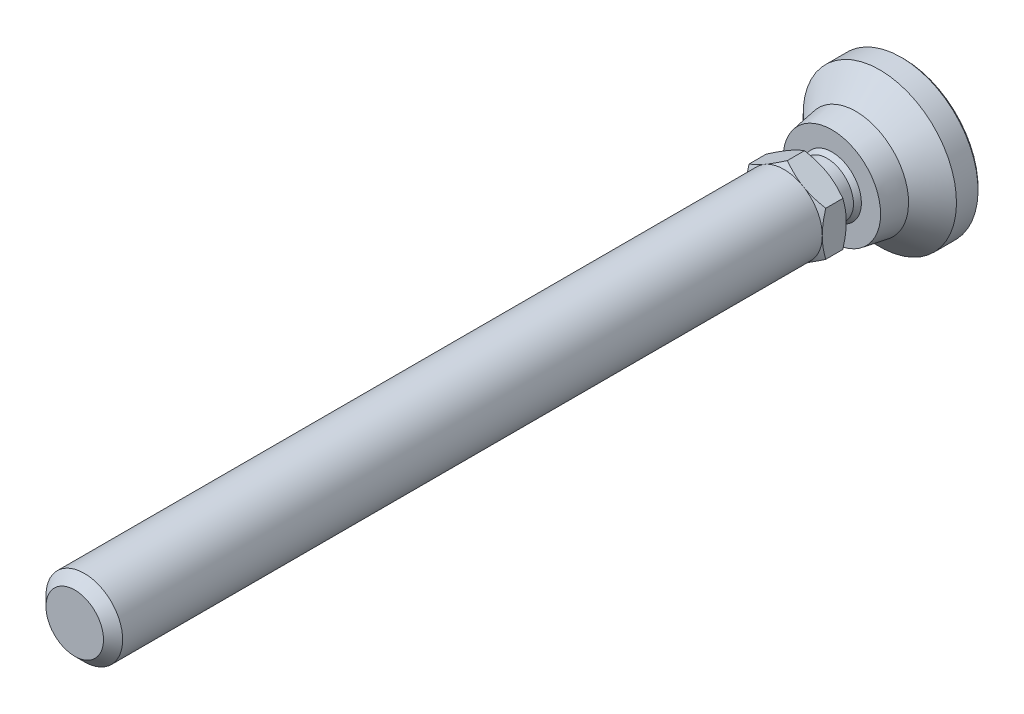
ISO-10303-21;
HEADER;
FILE_DESCRIPTION(('STEP AP214'),'2;1');
FILE_NAME('part.step','',(''),(''),'','','');
FILE_SCHEMA(('AUTOMOTIVE_DESIGN { 1 0 10303 214 1 1 1 1 }'));
ENDSEC;
DATA;
#1=APPLICATION_CONTEXT('core data for automotive mechanical design processes');
#2=APPLICATION_PROTOCOL_DEFINITION('international standard','automotive_design',2000,#1);
#3=PRODUCT_CONTEXT('',#1,'mechanical');
#4=PRODUCT('Part','Part','',(#3));
#5=PRODUCT_RELATED_PRODUCT_CATEGORY('part','',(#4));
#6=PRODUCT_DEFINITION_FORMATION('','',#4);
#7=PRODUCT_DEFINITION_CONTEXT('part definition',#1,'design');
#8=PRODUCT_DEFINITION('design','',#6,#7);
#9=PRODUCT_DEFINITION_SHAPE('','',#8);
#10=(LENGTH_UNIT() NAMED_UNIT(*) SI_UNIT(.MILLI.,.METRE.));
#11=(NAMED_UNIT(*) PLANE_ANGLE_UNIT() SI_UNIT($,.RADIAN.));
#12=(NAMED_UNIT(*) SI_UNIT($,.STERADIAN.) SOLID_ANGLE_UNIT());
#13=UNCERTAINTY_MEASURE_WITH_UNIT(LENGTH_MEASURE(1.E-05),#10,'distance_accuracy_value','');
#14=(GEOMETRIC_REPRESENTATION_CONTEXT(3) GLOBAL_UNCERTAINTY_ASSIGNED_CONTEXT((#13)) GLOBAL_UNIT_ASSIGNED_CONTEXT((#10,
#11,#12)) REPRESENTATION_CONTEXT('',''));
#15=CARTESIAN_POINT('',(0.,0.,0.));
#16=DIRECTION('',(0.,0.,1.));
#17=DIRECTION('',(1.,0.,0.));
#18=AXIS2_PLACEMENT_3D('',#15,#16,#17);
#19=CARTESIAN_POINT('',(-7.7647058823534,0.,20.));
#20=DIRECTION('',(0.,0.,1.));
#21=DIRECTION('',(0.,-1.,0.));
#22=AXIS2_PLACEMENT_3D('',#19,#20,#21);
#23=PLANE('',#22);
#24=CARTESIAN_POINT('',(0.,0.,20.));
#25=DIRECTION('',(0.,0.,-1.));
#26=DIRECTION('',(0.,1.,0.));
#27=AXIS2_PLACEMENT_3D('',#24,#25,#26);
#28=CIRCLE('',#27,5.50000000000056);
#29=CARTESIAN_POINT('',(0.,5.50000000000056,20.));
#30=VERTEX_POINT('',#29);
#31=EDGE_CURVE('E275',#30,#30,#28,.T.);
#32=ORIENTED_EDGE('',*,*,#31,.F.);
#33=EDGE_LOOP('',(#32));
#34=FACE_BOUND('',#33,.T.);
#35=CARTESIAN_POINT('',(0.,0.,20.));
#36=DIRECTION('',(0.,0.,1.));
#37=DIRECTION('',(0.,-1.,0.));
#38=AXIS2_PLACEMENT_3D('',#35,#36,#37);
#39=CIRCLE('',#38,8.);
#40=CARTESIAN_POINT('',(4.,-6.92820323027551,20.));
#41=VERTEX_POINT('',#40);
#42=CARTESIAN_POINT('',(-4.,-6.92820323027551,20.));
#43=VERTEX_POINT('',#42);
#44=EDGE_CURVE('E17',#41,#43,#39,.F.);
#45=ORIENTED_EDGE('',*,*,#44,.T.);
#46=CARTESIAN_POINT('',(-8.,0.,20.));
#47=VERTEX_POINT('',#46);
#48=EDGE_CURVE('E9',#43,#47,#39,.F.);
#49=ORIENTED_EDGE('',*,*,#48,.T.);
#50=CARTESIAN_POINT('',(-4.,6.92820323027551,20.));
#51=VERTEX_POINT('',#50);
#52=EDGE_CURVE('E22',#47,#51,#39,.F.);
#53=ORIENTED_EDGE('',*,*,#52,.T.);
#54=CARTESIAN_POINT('',(4.,6.92820323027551,20.));
#55=VERTEX_POINT('',#54);
#56=EDGE_CURVE('E404',#51,#55,#39,.F.);
#57=ORIENTED_EDGE('',*,*,#56,.T.);
#58=CARTESIAN_POINT('',(8.,0.,20.));
#59=VERTEX_POINT('',#58);
#60=EDGE_CURVE('E120',#55,#59,#39,.F.);
#61=ORIENTED_EDGE('',*,*,#60,.T.);
#62=CARTESIAN_POINT('',(0.,0.,20.));
#63=DIRECTION('',(0.,0.,1.));
#64=DIRECTION('',(0.,-1.,0.));
#65=AXIS2_PLACEMENT_3D('',#62,#63,#64);
#66=CIRCLE('',#65,8.);
#67=EDGE_CURVE('E104',#41,#59,#66,.T.);
#68=ORIENTED_EDGE('',*,*,#67,.F.);
#69=EDGE_LOOP('',(#45,#49,#53,#57,#61,#68));
#70=FACE_BOUND('',#69,.T.);
#71=ADVANCED_FACE('F14',(#34,#70),#23,.F.);
#72=CARTESIAN_POINT('',(0.,0.,0.));
#73=DIRECTION('',(0.,0.,-1.));
#74=DIRECTION('',(0.,1.,0.));
#75=AXIS2_PLACEMENT_3D('',#72,#73,#74);
#76=CYLINDRICAL_SURFACE('',#75,5.50000000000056);
#77=CARTESIAN_POINT('',(0.,0.,15.9999999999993));
#78=DIRECTION('',(0.,0.,-1.));
#79=DIRECTION('',(0.,1.,0.));
#80=AXIS2_PLACEMENT_3D('',#77,#78,#79);
#81=CIRCLE('',#80,5.50000000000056);
#82=CARTESIAN_POINT('',(0.,-5.50000000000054,15.9999999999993));
#83=VERTEX_POINT('',#82);
#84=EDGE_CURVE('E239',#83,#83,#81,.T.);
#85=ORIENTED_EDGE('',*,*,#84,.F.);
#86=EDGE_LOOP('',(#85));
#87=FACE_BOUND('',#86,.T.);
#88=ORIENTED_EDGE('',*,*,#31,.T.);
#89=EDGE_LOOP('',(#88));
#90=FACE_BOUND('',#89,.T.);
#91=ADVANCED_FACE('F342',(#87,#90),#76,.T.);
#92=CARTESIAN_POINT('',(0.,0.,11.6698729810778));
#93=DIRECTION('',(0.,0.,-1.));
#94=DIRECTION('',(0.,-1.,0.));
#95=AXIS2_PLACEMENT_3D('',#92,#93,#94);
#96=SPHERICAL_SURFACE('',#95,7.);
#97=CARTESIAN_POINT('',(0.,0.,15.));
#98=DIRECTION('',(0.,0.,-1.));
#99=DIRECTION('',(0.,1.,0.));
#100=AXIS2_PLACEMENT_3D('',#97,#98,#99);
#101=CIRCLE('',#100,6.15713034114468);
#102=CARTESIAN_POINT('',(0.,-6.15713034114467,15.));
#103=VERTEX_POINT('',#102);
#104=EDGE_CURVE('E243',#103,#103,#101,.T.);
#105=CARTESIAN_POINT('',(0.,-5.50000000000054,15.9999999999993));
#106=CARTESIAN_POINT('',(0.,-5.50771979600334,15.9901945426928));
#107=CARTESIAN_POINT('',(0.,-5.5154133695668,15.9803684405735));
#108=CARTESIAN_POINT('',(0.,-5.5307478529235,15.9606752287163));
#109=CARTESIAN_POINT('',(0.,-5.53838876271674,15.9508081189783));
#110=CARTESIAN_POINT('',(0.,-5.55361769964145,15.9310331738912));
#111=CARTESIAN_POINT('',(0.,-5.56120572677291,15.9211253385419));
#112=CARTESIAN_POINT('',(0.,-5.57632868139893,15.9012692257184));
#113=CARTESIAN_POINT('',(0.,-5.58386360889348,15.8913209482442));
#114=CARTESIAN_POINT('',(0.,-5.59888014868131,15.8713842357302));
#115=CARTESIAN_POINT('',(0.,-5.60636176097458,15.8613958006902));
#116=CARTESIAN_POINT('',(0.,-5.62127145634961,15.8413790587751));
#117=CARTESIAN_POINT('',(0.,-5.62869953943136,15.8313507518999));
#118=CARTESIAN_POINT('',(0.,-5.64350196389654,15.8112545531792));
#119=CARTESIAN_POINT('',(0.,-5.65087630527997,15.8011866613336));
#120=CARTESIAN_POINT('',(0.,-5.66557103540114,15.7810115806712));
#121=CARTESIAN_POINT('',(0.,-5.67289142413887,15.7709043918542));
#122=CARTESIAN_POINT('',(0.,-5.68747803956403,15.7506510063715));
#123=CARTESIAN_POINT('',(0.,-5.69474426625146,15.7405048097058));
#124=CARTESIAN_POINT('',(0.,-5.70922234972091,15.7201736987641));
#125=CARTESIAN_POINT('',(0.,-5.71643420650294,15.7099887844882));
#126=CARTESIAN_POINT('',(0.,-5.73080334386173,15.6895805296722));
#127=CARTESIAN_POINT('',(0.,-5.73796062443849,15.6793571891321));
#128=CARTESIAN_POINT('',(0.,-5.75222040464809,15.6588723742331));
#129=CARTESIAN_POINT('',(0.,-5.75932290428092,15.6486108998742));
#130=CARTESIAN_POINT('',(0.,-5.77347291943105,15.6280501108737));
#131=CARTESIAN_POINT('',(0.,-5.78052043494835,15.6177507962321));
#132=CARTESIAN_POINT('',(0.,-5.79456028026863,15.5971146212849));
#133=CARTESIAN_POINT('',(0.,-5.80155261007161,15.5867777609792));
#134=CARTESIAN_POINT('',(0.,-5.81548188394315,15.5660667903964));
#135=CARTESIAN_POINT('',(0.,-5.82241882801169,15.5556926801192));
#136=CARTESIAN_POINT('',(0.,-5.83623713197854,15.5349075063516));
#137=CARTESIAN_POINT('',(0.,-5.84311849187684,15.5244964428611));
#138=CARTESIAN_POINT('',(0.,-5.85682543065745,15.503637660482));
#139=CARTESIAN_POINT('',(0.,-5.86365100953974,15.4931899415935));
#140=CARTESIAN_POINT('',(0.,-5.8772461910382,15.4722581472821));
#141=CARTESIAN_POINT('',(0.,-5.88401579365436,15.4617740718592));
#142=CARTESIAN_POINT('',(0.,-5.89749882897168,15.440769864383));
#143=CARTESIAN_POINT('',(0.,-5.90421226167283,15.4302497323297));
#144=CARTESIAN_POINT('',(0.,-5.91758276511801,15.4091737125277));
#145=CARTESIAN_POINT('',(0.,-5.92423983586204,15.398617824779));
#146=CARTESIAN_POINT('',(0.,-5.93749742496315,15.3774705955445));
#147=CARTESIAN_POINT('',(0.,-5.94409794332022,15.3668792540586));
#148=CARTESIAN_POINT('',(0.,-5.9572422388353,15.3456614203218));
#149=CARTESIAN_POINT('',(0.,-5.96378601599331,15.3350349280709));
#150=CARTESIAN_POINT('',(0.,-5.97681664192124,15.3137470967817));
#151=CARTESIAN_POINT('',(0.,-5.98330349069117,15.3030857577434));
#152=CARTESIAN_POINT('',(0.,-5.99622007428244,15.2817285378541));
#153=CARTESIAN_POINT('',(0.,-6.00264980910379,15.271032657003));
#154=CARTESIAN_POINT('',(0.,-6.0154519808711,15.2496066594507));
#155=CARTESIAN_POINT('',(0.,-6.02182441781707,15.2388765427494));
#156=CARTESIAN_POINT('',(0.,-6.03451181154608,15.2173823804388));
#157=CARTESIAN_POINT('',(0.,-6.04082676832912,15.2066183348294));
#158=CARTESIAN_POINT('',(0.,-6.05339902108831,15.1850566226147));
#159=CARTESIAN_POINT('',(0.,-6.05965631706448,15.1742589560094));
#160=CARTESIAN_POINT('',(0.,-6.07211306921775,15.1526303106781));
#161=CARTESIAN_POINT('',(0.,-6.07831252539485,15.1417993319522));
#162=CARTESIAN_POINT('',(0.,-6.09065342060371,15.1201043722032));
#163=CARTESIAN_POINT('',(0.,-6.09679485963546,15.1092403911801));
#164=CARTESIAN_POINT('',(0.,-6.10901954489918,15.0874797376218));
#165=CARTESIAN_POINT('',(0.,-6.11510279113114,15.0765830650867));
#166=CARTESIAN_POINT('',(0.,-6.12721091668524,15.0547573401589));
#167=CARTESIAN_POINT('',(0.,-6.13323579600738,15.0438282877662));
#168=CARTESIAN_POINT('',(0.,-6.14522701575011,15.0219381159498));
#169=CARTESIAN_POINT('',(0.,-6.15119335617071,15.010976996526));
#170=CARTESIAN_POINT('',(0.,-6.15713034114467,15.));
#171=B_SPLINE_CURVE_WITH_KNOTS('',3,(#105,#106,#107,#108,#109,#110,#111,#112,#113,#114,#115,
#116,#117,#118,#119,#120,#121,#122,#123,#124,#125,#126,#127,#128,#129,#130,#131,#132,#133,#134,
#135,#136,#137,#138,#139,#140,#141,#142,#143,#144,#145,#146,#147,#148,#149,#150,#151,#152,#153,
#154,#155,#156,#157,#158,#159,#160,#161,#162,#163,#164,#165,#166,#167,#168,#169,#170),
.UNSPECIFIED.,.F.,.F.,(4,2,2,2,2,2,2,2,2,2,2,2,2,2,2,2,2,2,2,2,2,2,2,2,2,2,2,2,2,2,2,2,4),(0.,
0.0374389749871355,0.0748779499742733,0.11231692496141,0.149755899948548,0.187194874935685,
0.224633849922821,0.262072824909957,0.299511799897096,0.336950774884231,0.374389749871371,
0.411828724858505,0.449267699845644,0.486706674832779,0.524145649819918,0.561584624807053,
0.59902359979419,0.636462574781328,0.673901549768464,0.711340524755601,0.748779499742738,
0.786218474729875,0.823657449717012,0.86109642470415,0.898535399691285,0.935974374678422,
0.973413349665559,1.0108523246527,1.04829129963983,1.08573027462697,1.12316924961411,
1.16060822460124,1.19804719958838),.UNSPECIFIED.);
#172=EDGE_CURVE('BSEAM338',#83,#103,#171,.T.);
#173=ORIENTED_EDGE('',*,*,#84,.T.);
#174=ORIENTED_EDGE('',*,*,#104,.F.);
#175=ORIENTED_EDGE('',*,*,#172,.T.);
#176=ORIENTED_EDGE('',*,*,#172,.F.);
#177=EDGE_LOOP('',(#173,#175,#174,#176));
#178=FACE_BOUND('',#177,.T.);
#179=ADVANCED_FACE('F338',(#178),#96,.T.);
#180=CARTESIAN_POINT('',(-15.5,0.,0.));
#181=DIRECTION('',(0.,0.,1.));
#182=DIRECTION('',(0.,-1.,0.));
#183=AXIS2_PLACEMENT_3D('',#180,#181,#182);
#184=PLANE('',#183);
#185=CARTESIAN_POINT('',(0.,0.,0.));
#186=DIRECTION('',(0.,0.,-1.));
#187=DIRECTION('',(0.,1.,0.));
#188=AXIS2_PLACEMENT_3D('',#185,#186,#187);
#189=CIRCLE('',#188,15.5);
#190=CARTESIAN_POINT('',(0.,15.5,0.));
#191=VERTEX_POINT('',#190);
#192=EDGE_CURVE('E264',#191,#191,#189,.T.);
#193=ORIENTED_EDGE('',*,*,#192,.T.);
#194=EDGE_LOOP('',(#193));
#195=FACE_BOUND('',#194,.T.);
#196=ADVANCED_FACE('F341',(#195),#184,.F.);
#197=CARTESIAN_POINT('',(0.,0.,0.500000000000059));
#198=DIRECTION('',(0.,0.,1.));
#199=DIRECTION('',(0.,-1.,0.));
#200=AXIS2_PLACEMENT_3D('',#197,#198,#199);
#201=CONICAL_SURFACE('',#200,16.,0.785398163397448);
#202=ORIENTED_EDGE('',*,*,#192,.F.);
#203=EDGE_LOOP('',(#202));
#204=FACE_BOUND('',#203,.T.);
#205=CARTESIAN_POINT('',(0.,0.,0.500000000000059));
#206=DIRECTION('',(0.,0.,-1.));
#207=DIRECTION('',(0.,1.,0.));
#208=AXIS2_PLACEMENT_3D('',#205,#206,#207);
#209=CIRCLE('',#208,16.);
#210=CARTESIAN_POINT('',(0.,16.,0.500000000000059));
#211=VERTEX_POINT('',#210);
#212=EDGE_CURVE('E267',#211,#211,#209,.T.);
#213=ORIENTED_EDGE('',*,*,#212,.T.);
#214=EDGE_LOOP('',(#213));
#215=FACE_BOUND('',#214,.T.);
#216=ADVANCED_FACE('F375',(#204,#215),#201,.T.);
#217=CARTESIAN_POINT('',(0.,0.,0.));
#218=DIRECTION('',(0.,0.,-1.));
#219=DIRECTION('',(0.,1.,0.));
#220=AXIS2_PLACEMENT_3D('',#217,#218,#219);
#221=CYLINDRICAL_SURFACE('',#220,16.);
#222=ORIENTED_EDGE('',*,*,#212,.F.);
#223=EDGE_LOOP('',(#222));
#224=FACE_BOUND('',#223,.T.);
#225=CARTESIAN_POINT('',(0.,0.,5.));
#226=DIRECTION('',(0.,0.,-1.));
#227=DIRECTION('',(0.,1.,0.));
#228=AXIS2_PLACEMENT_3D('',#225,#226,#227);
#229=CIRCLE('',#228,16.);
#230=CARTESIAN_POINT('',(0.,16.,5.));
#231=VERTEX_POINT('',#230);
#232=EDGE_CURVE('E270',#231,#231,#229,.T.);
#233=ORIENTED_EDGE('',*,*,#232,.T.);
#234=EDGE_LOOP('',(#233));
#235=FACE_BOUND('',#234,.T.);
#236=ADVANCED_FACE('F371',(#224,#235),#221,.T.);
#237=CARTESIAN_POINT('',(0.,0.,10.));
#238=DIRECTION('',(0.,0.,-1.));
#239=DIRECTION('',(0.,1.,0.));
#240=AXIS2_PLACEMENT_3D('',#237,#238,#239);
#241=CONICAL_SURFACE('',#240,11.,0.785398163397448);
#242=ORIENTED_EDGE('',*,*,#232,.F.);
#243=EDGE_LOOP('',(#242));
#244=FACE_BOUND('',#243,.T.);
#245=CARTESIAN_POINT('',(0.,0.,10.));
#246=DIRECTION('',(0.,0.,-1.));
#247=DIRECTION('',(0.,1.,0.));
#248=AXIS2_PLACEMENT_3D('',#245,#246,#247);
#249=CIRCLE('',#248,11.);
#250=CARTESIAN_POINT('',(0.,11.,10.));
#251=VERTEX_POINT('',#250);
#252=EDGE_CURVE('E273',#251,#251,#249,.T.);
#253=ORIENTED_EDGE('',*,*,#252,.T.);
#254=EDGE_LOOP('',(#253));
#255=FACE_BOUND('',#254,.T.);
#256=ADVANCED_FACE('F367',(#244,#255),#241,.T.);
#257=CARTESIAN_POINT('',(0.,0.,16.));
#258=DIRECTION('',(0.,0.,-1.));
#259=DIRECTION('',(0.,1.,0.));
#260=AXIS2_PLACEMENT_3D('',#257,#258,#259);
#261=CONICAL_SURFACE('',#260,10.,0.165148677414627);
#262=CARTESIAN_POINT('',(0.,0.,15.));
#263=DIRECTION('',(0.,0.,1.));
#264=DIRECTION('',(0.,-1.,0.));
#265=AXIS2_PLACEMENT_3D('',#262,#263,#264);
#266=CIRCLE('',#265,10.1666666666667);
#267=CARTESIAN_POINT('',(0.,-10.1666666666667,15.));
#268=VERTEX_POINT('',#267);
#269=EDGE_CURVE('E246',#268,#268,#266,.T.);
#270=ORIENTED_EDGE('',*,*,#269,.F.);
#271=EDGE_LOOP('',(#270));
#272=FACE_BOUND('',#271,.T.);
#273=ORIENTED_EDGE('',*,*,#252,.F.);
#274=EDGE_LOOP('',(#273));
#275=FACE_BOUND('',#274,.T.);
#276=ADVANCED_FACE('F336',(#272,#275),#261,.T.);
#277=CARTESIAN_POINT('',(-6.60079601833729,0.,15.));
#278=DIRECTION('',(0.,0.,-1.));
#279=DIRECTION('',(0.,1.,0.));
#280=AXIS2_PLACEMENT_3D('',#277,#278,#279);
#281=PLANE('',#280);
#282=ORIENTED_EDGE('',*,*,#269,.T.);
#283=EDGE_LOOP('',(#282));
#284=FACE_BOUND('',#283,.T.);
#285=ORIENTED_EDGE('',*,*,#104,.T.);
#286=EDGE_LOOP('',(#285));
#287=FACE_BOUND('',#286,.T.);
#288=ADVANCED_FACE('F332',(#284,#287),#281,.F.);
#289=CARTESIAN_POINT('',(0.,0.,20.));
#290=DIRECTION('',(0.,0.,1.));
#291=DIRECTION('',(0.,-1.,0.));
#292=AXIS2_PLACEMENT_3D('',#289,#290,#291);
#293=CONICAL_SURFACE('',#292,8.,1.0471975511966);
#294=ORIENTED_EDGE('',*,*,#44,.F.);
#295=CARTESIAN_POINT('',(-0.00019999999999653,-9.23771977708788,20.714597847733));
#296=CARTESIAN_POINT('',(0.175648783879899,-9.13619343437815,20.6559907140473));
#297=CARTESIAN_POINT('',(0.352153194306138,-9.03428856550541,20.6000434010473));
#298=CARTESIAN_POINT('',(0.706595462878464,-8.82965122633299,20.4942010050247));
#299=CARTESIAN_POINT('',(0.884533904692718,-8.72691841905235,20.4443085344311));
#300=CARTESIAN_POINT('',(1.42119823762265,-8.41707512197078,20.3046927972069));
#301=CARTESIAN_POINT('',(1.78204258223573,-8.20874154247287,20.2252811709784));
#302=CARTESIAN_POINT('',(2.32203917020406,-7.89697436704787,20.1321616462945));
#303=CARTESIAN_POINT('',(2.49957818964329,-7.79447216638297,20.1056345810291));
#304=CARTESIAN_POINT('',(2.85545911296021,-7.5890042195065,20.0611531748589));
#305=CARTESIAN_POINT('',(3.03380094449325,-7.48603851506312,20.0431980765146));
#306=CARTESIAN_POINT('',(3.39079168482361,-7.27992981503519,20.0163156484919));
#307=CARTESIAN_POINT('',(3.56944001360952,-7.17678715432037,20.0073780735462));
#308=CARTESIAN_POINT('',(3.9269017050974,-6.97040655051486,19.9987223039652));
#309=CARTESIAN_POINT('',(4.10571506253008,-6.8671686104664,19.9990038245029));
#310=CARTESIAN_POINT('',(4.44001336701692,-6.67416139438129,20.0081450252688));
#311=CARTESIAN_POINT('',(4.59552190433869,-6.58437849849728,20.0158896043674));
#312=CARTESIAN_POINT('',(4.90617476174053,-6.4050229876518,20.0382011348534));
#313=CARTESIAN_POINT('',(5.06131905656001,-6.31545038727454,20.0527685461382));
#314=CARTESIAN_POINT('',(5.52615131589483,-6.04707935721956,20.1063606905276));
#315=CARTESIAN_POINT('',(5.83501648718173,-5.86875596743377,20.1552686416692));
#316=CARTESIAN_POINT('',(6.45602322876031,-5.5102175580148,20.2775394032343));
#317=CARTESIAN_POINT('',(6.76808554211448,-5.33004829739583,20.351420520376));
#318=CARTESIAN_POINT('',(7.38755648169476,-4.97239658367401,20.519100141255));
#319=CARTESIAN_POINT('',(7.69497304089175,-4.79490955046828,20.6128592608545));
#320=CARTESIAN_POINT('',(8.0002,-4.6186866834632,20.714597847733));
#321=B_SPLINE_CURVE_WITH_KNOTS('',3,(#295,#296,#297,#298,#299,#300,#301,#302,#303,#304,#305,
#306,#307,#308,#309,#310,#311,#312,#313,#314,#315,#316,#317,#318,#319,#320),.UNSPECIFIED.,.F.,
.F.,(4,2,2,2,2,2,2,2,2,2,2,2,4),(0.,0.633973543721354,1.26821965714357,2.53934712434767,
3.1593434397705,3.77928496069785,4.39852133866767,5.01773858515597,5.5568023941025,
6.09590254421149,7.17487077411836,8.27776850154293,9.37850115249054),.UNSPECIFIED.);
#322=CARTESIAN_POINT('',(0.,-9.23760430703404,20.7145311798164));
#323=VERTEX_POINT('',#322);
#324=EDGE_CURVE('E112',#323,#41,#321,.T.);
#325=ORIENTED_EDGE('',*,*,#324,.F.);
#326=CARTESIAN_POINT('',(-8.0002,-4.6186866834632,20.714597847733));
#327=CARTESIAN_POINT('',(-7.82435121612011,-4.72021302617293,20.6559907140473));
#328=CARTESIAN_POINT('',(-7.64784680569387,-4.82211789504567,20.6000434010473));
#329=CARTESIAN_POINT('',(-7.29340453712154,-5.02675523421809,20.4942010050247));
#330=CARTESIAN_POINT('',(-7.11546609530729,-5.12948804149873,20.4443085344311));
#331=CARTESIAN_POINT('',(-6.57880176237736,-5.4393313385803,20.3046927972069));
#332=CARTESIAN_POINT('',(-6.21795741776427,-5.64766491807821,20.2252811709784));
#333=CARTESIAN_POINT('',(-5.67796082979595,-5.9594320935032,20.1321616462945));
#334=CARTESIAN_POINT('',(-5.50042181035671,-6.06193429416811,20.1056345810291));
#335=CARTESIAN_POINT('',(-5.1445408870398,-6.26740224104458,20.0611531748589));
#336=CARTESIAN_POINT('',(-4.96619905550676,-6.37036794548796,20.0431980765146));
#337=CARTESIAN_POINT('',(-4.6092083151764,-6.57647664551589,20.0163156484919));
#338=CARTESIAN_POINT('',(-4.43055998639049,-6.67961930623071,20.0073780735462));
#339=CARTESIAN_POINT('',(-4.07309829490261,-6.88599991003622,19.9987223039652));
#340=CARTESIAN_POINT('',(-3.89428493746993,-6.98923785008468,19.9990038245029));
#341=CARTESIAN_POINT('',(-3.55998663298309,-7.18224506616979,20.0081450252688));
#342=CARTESIAN_POINT('',(-3.40447809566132,-7.2720279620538,20.0158896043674));
#343=CARTESIAN_POINT('',(-3.09382523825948,-7.45138347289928,20.0382011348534));
#344=CARTESIAN_POINT('',(-2.93868094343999,-7.54095607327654,20.0527685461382));
#345=CARTESIAN_POINT('',(-2.47384868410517,-7.80932710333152,20.1063606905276));
#346=CARTESIAN_POINT('',(-2.16498351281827,-7.98765049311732,20.1552686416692));
#347=CARTESIAN_POINT('',(-1.54397677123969,-8.34618890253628,20.2775394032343));
#348=CARTESIAN_POINT('',(-1.23191445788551,-8.52635816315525,20.351420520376));
#349=CARTESIAN_POINT('',(-0.612443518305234,-8.88400987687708,20.519100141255));
#350=CARTESIAN_POINT('',(-0.305026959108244,-9.06149691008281,20.6128592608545));
#351=CARTESIAN_POINT('',(0.000200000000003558,-9.23771977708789,20.714597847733));
#352=B_SPLINE_CURVE_WITH_KNOTS('',3,(#326,#327,#328,#329,#330,#331,#332,#333,#334,#335,#336,
#337,#338,#339,#340,#341,#342,#343,#344,#345,#346,#347,#348,#349,#350,#351),.UNSPECIFIED.,.F.,
.F.,(4,2,2,2,2,2,2,2,2,2,2,2,4),(0.,0.633973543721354,1.26821965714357,2.53934712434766,
3.1593434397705,3.77928496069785,4.39852133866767,5.01773858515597,5.5568023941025,
6.09590254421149,7.17487077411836,8.27776850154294,9.37850115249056),.UNSPECIFIED.);
#353=EDGE_CURVE('E118',#43,#323,#352,.T.);
#354=ORIENTED_EDGE('',*,*,#353,.F.);
#355=EDGE_LOOP('',(#294,#325,#354));
#356=FACE_BOUND('',#355,.T.);
#357=ADVANCED_FACE('F116',(#356),#293,.T.);
#358=ORIENTED_EDGE('',*,*,#67,.T.);
#359=CARTESIAN_POINT('',(8.,12.3319770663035,23.8680044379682));
#360=CARTESIAN_POINT('',(8.,11.9831880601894,23.699112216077));
#361=CARTESIAN_POINT('',(7.99999999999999,11.633590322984,23.5318611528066));
#362=CARTESIAN_POINT('',(7.99999999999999,10.9323470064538,23.2015658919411));
#363=CARTESIAN_POINT('',(7.99999999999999,10.580701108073,23.0385223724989));
#364=CARTESIAN_POINT('',(7.99999999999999,9.8730831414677,22.7167303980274));
#365=CARTESIAN_POINT('',(7.99999999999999,9.51709789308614,22.5580108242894));
#366=CARTESIAN_POINT('',(7.99999999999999,8.80226983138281,22.2471675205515));
#367=CARTESIAN_POINT('',(7.99999999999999,8.4434271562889,22.0950434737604));
#368=CARTESIAN_POINT('',(7.99999999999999,7.71101365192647,21.7944982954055));
#369=CARTESIAN_POINT('',(7.99999999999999,7.33733344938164,21.6463422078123));
#370=CARTESIAN_POINT('',(7.99999999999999,6.58557460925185,21.3614249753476));
#371=CARTESIAN_POINT('',(8.,6.20749547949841,21.2246651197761));
#372=CARTESIAN_POINT('',(8.,5.44706490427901,20.9661859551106));
#373=CARTESIAN_POINT('',(7.99999999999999,5.06472414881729,20.8444355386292));
#374=CARTESIAN_POINT('',(8.,4.29457293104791,20.6199294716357));
#375=CARTESIAN_POINT('',(8.,3.90676425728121,20.5171677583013));
#376=CARTESIAN_POINT('',(8.,3.12753472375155,20.336170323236));
#377=CARTESIAN_POINT('',(8.,2.73614501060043,20.2578041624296));
#378=CARTESIAN_POINT('',(8.,2.14555681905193,20.1619802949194));
#379=CARTESIAN_POINT('',(8.,1.94809503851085,20.1336585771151));
#380=CARTESIAN_POINT('',(8.,1.55221561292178,20.0848140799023));
#381=CARTESIAN_POINT('',(8.,1.35379806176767,20.0642905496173));
#382=CARTESIAN_POINT('',(8.,0.958831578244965,20.0317048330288));
#383=CARTESIAN_POINT('',(8.,0.762291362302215,20.0195373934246));
#384=CARTESIAN_POINT('',(8.,0.368872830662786,20.0035194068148));
#385=CARTESIAN_POINT('',(8.,0.171994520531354,19.9996687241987));
#386=CARTESIAN_POINT('',(8.,-0.221749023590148,20.0003759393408));
#387=CARTESIAN_POINT('',(8.,-0.418614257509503,20.0049338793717));
#388=CARTESIAN_POINT('',(8.,-0.811979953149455,20.022348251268));
#389=CARTESIAN_POINT('',(8.,-1.00848039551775,20.0352051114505));
#390=CARTESIAN_POINT('',(8.,-1.48303042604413,20.0760062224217));
#391=CARTESIAN_POINT('',(8.,-1.76073763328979,20.1080156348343));
#392=CARTESIAN_POINT('',(8.,-2.31402830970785,20.1868459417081));
#393=CARTESIAN_POINT('',(8.,-2.58961147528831,20.2336689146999));
#394=CARTESIAN_POINT('',(8.,-3.41289582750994,20.3938699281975));
#395=CARTESIAN_POINT('',(8.,-3.95681068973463,20.5269488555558));
#396=CARTESIAN_POINT('',(8.,-4.76998860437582,20.7569237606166));
#397=CARTESIAN_POINT('',(8.,-5.04348973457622,20.8396893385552));
#398=CARTESIAN_POINT('',(8.,-5.58783440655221,21.0136193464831));
#399=CARTESIAN_POINT('',(8.,-5.85867793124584,21.104783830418));
#400=CARTESIAN_POINT('',(8.,-6.39779622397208,21.2940654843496));
#401=CARTESIAN_POINT('',(8.,-6.66607185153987,21.3921802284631));
#402=CARTESIAN_POINT('',(8.,-7.20041400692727,21.5942277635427));
#403=CARTESIAN_POINT('',(8.,-7.46648055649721,21.6981604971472));
#404=CARTESIAN_POINT('',(8.,-8.07678474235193,21.9430258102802));
#405=CARTESIAN_POINT('',(8.,-8.42034349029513,22.0856469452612));
#406=CARTESIAN_POINT('',(8.,-9.10467771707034,22.3774344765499));
#407=CARTESIAN_POINT('',(8.,-9.44545305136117,22.5266012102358));
#408=CARTESIAN_POINT('',(8.,-10.1247159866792,22.8302171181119));
#409=CARTESIAN_POINT('',(8.,-10.4632031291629,22.9846673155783));
#410=CARTESIAN_POINT('',(8.,-11.138190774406,23.2978252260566));
#411=CARTESIAN_POINT('',(8.,-11.4746913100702,23.4565328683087));
#412=CARTESIAN_POINT('',(8.,-12.1463310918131,23.7775830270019));
#413=CARTESIAN_POINT('',(8.,-12.48146880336,23.9399287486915));
#414=CARTESIAN_POINT('',(8.,-13.1503280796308,24.2675141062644));
#415=CARTESIAN_POINT('',(8.,-13.4840496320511,24.4327537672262));
#416=CARTESIAN_POINT('',(8.,-14.4834320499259,24.9320757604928));
#417=CARTESIAN_POINT('',(8.,-15.1472968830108,25.2697544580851));
#418=CARTESIAN_POINT('',(8.,-16.1140978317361,25.767815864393));
#419=CARTESIAN_POINT('',(8.00000000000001,-16.4184273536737,25.9255107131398));
#420=CARTESIAN_POINT('',(8.00000000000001,-17.0264220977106,26.2421643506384));
#421=CARTESIAN_POINT('',(8.00000000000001,-17.3300873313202,26.4011231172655));
#422=CARTESIAN_POINT('',(8.00000000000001,-18.2402419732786,26.8796541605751));
#423=CARTESIAN_POINT('',(8.00000000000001,-18.8458674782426,27.2008693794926));
#424=CARTESIAN_POINT('',(8.00000000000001,-20.0539390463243,27.8459173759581));
#425=CARTESIAN_POINT('',(8.00000000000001,-20.6563892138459,28.1697424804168));
#426=CARTESIAN_POINT('',(8.00000000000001,-21.8598185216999,28.8200429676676));
#427=CARTESIAN_POINT('',(8.00000000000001,-22.4607977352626,29.1465182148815));
#428=CARTESIAN_POINT('',(8.,-23.0612301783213,29.4739895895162));
#429=B_SPLINE_CURVE_WITH_KNOTS('',3,(#359,#360,#361,#362,#363,#364,#365,#366,#367,#368,#369,
#370,#371,#372,#373,#374,#375,#376,#377,#378,#379,#380,#381,#382,#383,#384,#385,#386,#387,#388,
#389,#390,#391,#392,#393,#394,#395,#396,#397,#398,#399,#400,#401,#402,#403,#404,#405,#406,#407,
#408,#409,#410,#411,#412,#413,#414,#415,#416,#417,#418,#419,#420,#421,#422,#423,#424,#425,#426,
#427,#428),.UNSPECIFIED.,.F.,.F.,(4,2,2,2,2,2,2,2,2,2,2,2,2,2,2,2,2,2,2,2,2,2,2,2,2,2,2,2,2,2,2,
2,2,2,4),(0.,1.16260011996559,2.32538646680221,3.4946303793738,4.66381806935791,
5.86961090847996,7.07553997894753,8.27892614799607,9.48192742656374,10.6783813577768,
11.2766991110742,11.8749592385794,12.4655382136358,13.0561075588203,13.6466798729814,
14.2372826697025,15.0754450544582,15.913725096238,17.5912489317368,18.4484297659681,
19.3056161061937,20.1625047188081,21.01938488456,22.1352526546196,23.2511780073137,
24.3673207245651,25.4834449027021,26.6005944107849,27.7177536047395,29.9521179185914,
30.9803956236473,32.0086553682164,34.0652519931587,36.1171418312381,38.1689273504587),.UNSPECIFIED.);
#430=CARTESIAN_POINT('',(8.,-4.61880215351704,20.7145311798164));
#431=VERTEX_POINT('',#430);
#432=EDGE_CURVE('E107',#431,#59,#429,.F.);
#433=ORIENTED_EDGE('',*,*,#432,.F.);
#434=EDGE_CURVE('E100',#41,#431,#321,.T.);
#435=ORIENTED_EDGE('',*,*,#434,.F.);
#436=EDGE_LOOP('',(#358,#433,#435));
#437=FACE_BOUND('',#436,.T.);
#438=ADVANCED_FACE('F102',(#437),#293,.T.);
#439=ORIENTED_EDGE('',*,*,#60,.F.);
#440=CARTESIAN_POINT('',(8.0002,4.61868668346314,20.7145978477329));
#441=CARTESIAN_POINT('',(7.8243512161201,4.72021302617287,20.6559907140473));
#442=CARTESIAN_POINT('',(7.64784680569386,4.82211789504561,20.6000434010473));
#443=CARTESIAN_POINT('',(7.29340453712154,5.02675523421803,20.4942010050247));
#444=CARTESIAN_POINT('',(7.11546609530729,5.12948804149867,20.4443085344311));
#445=CARTESIAN_POINT('',(6.57880176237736,5.43933133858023,20.3046927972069));
#446=CARTESIAN_POINT('',(6.21795741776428,5.64766491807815,20.2252811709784));
#447=CARTESIAN_POINT('',(5.67796082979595,5.95943209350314,20.1321616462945));
#448=CARTESIAN_POINT('',(5.50042181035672,6.06193429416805,20.1056345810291));
#449=CARTESIAN_POINT('',(5.14454088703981,6.26740224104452,20.0611531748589));
#450=CARTESIAN_POINT('',(4.96619905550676,6.37036794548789,20.0431980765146));
#451=CARTESIAN_POINT('',(4.60920831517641,6.57647664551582,20.0163156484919));
#452=CARTESIAN_POINT('',(4.4305599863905,6.67961930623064,20.0073780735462));
#453=CARTESIAN_POINT('',(4.07309829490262,6.88599991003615,19.9987223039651));
#454=CARTESIAN_POINT('',(3.89428493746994,6.98923785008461,19.9990038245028));
#455=CARTESIAN_POINT('',(3.5599866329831,7.18224506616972,20.0081450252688));
#456=CARTESIAN_POINT('',(3.40447809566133,7.27202796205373,20.0158896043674));
#457=CARTESIAN_POINT('',(3.09382523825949,7.45138347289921,20.0382011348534));
#458=CARTESIAN_POINT('',(2.93868094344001,7.54095607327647,20.0527685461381));
#459=CARTESIAN_POINT('',(2.47384868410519,7.80932710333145,20.1063606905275));
#460=CARTESIAN_POINT('',(2.16498351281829,7.98765049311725,20.1552686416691));
#461=CARTESIAN_POINT('',(1.54397677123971,8.34618890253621,20.2775394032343));
#462=CARTESIAN_POINT('',(1.23191445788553,8.52635816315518,20.351420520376));
#463=CARTESIAN_POINT('',(0.612443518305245,8.88400987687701,20.519100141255));
#464=CARTESIAN_POINT('',(0.305026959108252,9.06149691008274,20.6128592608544));
#465=CARTESIAN_POINT('',(-0.000199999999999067,9.23771977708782,20.7145978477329));
#466=B_SPLINE_CURVE_WITH_KNOTS('',3,(#440,#441,#442,#443,#444,#445,#446,#447,#448,#449,#450,
#451,#452,#453,#454,#455,#456,#457,#458,#459,#460,#461,#462,#463,#464,#465),.UNSPECIFIED.,.F.,
.F.,(4,2,2,2,2,2,2,2,2,2,2,2,4),(0.,0.633973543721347,1.26821965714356,2.53934712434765,
3.15934343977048,3.77928496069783,4.39852133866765,5.01773858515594,5.55680239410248,
6.09590254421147,7.17487077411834,8.27776850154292,9.37850115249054),.UNSPECIFIED.);
#467=CARTESIAN_POINT('',(8.,4.61880215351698,20.7145311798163));
#468=VERTEX_POINT('',#467);
#469=EDGE_CURVE('E187',#468,#55,#466,.T.);
#470=ORIENTED_EDGE('',*,*,#469,.F.);
#471=EDGE_CURVE('E139',#59,#468,#429,.F.);
#472=ORIENTED_EDGE('',*,*,#471,.F.);
#473=EDGE_LOOP('',(#439,#470,#472));
#474=FACE_BOUND('',#473,.T.);
#475=ADVANCED_FACE('F403',(#474),#293,.T.);
#476=ORIENTED_EDGE('',*,*,#56,.F.);
#477=CARTESIAN_POINT('',(0.000199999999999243,9.23771977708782,20.7145978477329));
#478=CARTESIAN_POINT('',(-0.175648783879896,9.13619343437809,20.6559907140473));
#479=CARTESIAN_POINT('',(-0.352153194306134,9.03428856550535,20.6000434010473));
#480=CARTESIAN_POINT('',(-0.706595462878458,8.82965122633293,20.4942010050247));
#481=CARTESIAN_POINT('',(-0.884533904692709,8.72691841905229,20.4443085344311));
#482=CARTESIAN_POINT('',(-1.42119823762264,8.41707512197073,20.3046927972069));
#483=CARTESIAN_POINT('',(-1.78204258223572,8.20874154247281,20.2252811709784));
#484=CARTESIAN_POINT('',(-2.32203917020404,7.89697436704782,20.1321616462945));
#485=CARTESIAN_POINT('',(-2.49957818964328,7.79447216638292,20.1056345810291));
#486=CARTESIAN_POINT('',(-2.85545911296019,7.58900421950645,20.0611531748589));
#487=CARTESIAN_POINT('',(-3.03380094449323,7.48603851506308,20.0431980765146));
#488=CARTESIAN_POINT('',(-3.39079168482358,7.27992981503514,20.0163156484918));
#489=CARTESIAN_POINT('',(-3.56944001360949,7.17678715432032,20.0073780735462));
#490=CARTESIAN_POINT('',(-3.92690170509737,6.97040655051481,19.9987223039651));
#491=CARTESIAN_POINT('',(-4.10571506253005,6.86716861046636,19.9990038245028));
#492=CARTESIAN_POINT('',(-4.44001336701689,6.67416139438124,20.0081450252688));
#493=CARTESIAN_POINT('',(-4.59552190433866,6.58437849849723,20.0158896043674));
#494=CARTESIAN_POINT('',(-4.9061747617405,6.40502298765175,20.0382011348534));
#495=CARTESIAN_POINT('',(-5.06131905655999,6.31545038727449,20.0527685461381));
#496=CARTESIAN_POINT('',(-5.52615131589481,6.04707935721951,20.1063606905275));
#497=CARTESIAN_POINT('',(-5.83501648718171,5.86875596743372,20.1552686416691));
#498=CARTESIAN_POINT('',(-6.45602322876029,5.51021755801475,20.2775394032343));
#499=CARTESIAN_POINT('',(-6.76808554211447,5.33004829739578,20.351420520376));
#500=CARTESIAN_POINT('',(-7.38755648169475,4.97239658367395,20.519100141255));
#501=CARTESIAN_POINT('',(-7.69497304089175,4.79490955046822,20.6128592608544));
#502=CARTESIAN_POINT('',(-8.0002,4.61868668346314,20.7145978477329));
#503=B_SPLINE_CURVE_WITH_KNOTS('',3,(#477,#478,#479,#480,#481,#482,#483,#484,#485,#486,#487,
#488,#489,#490,#491,#492,#493,#494,#495,#496,#497,#498,#499,#500,#501,#502),.UNSPECIFIED.,.F.,
.F.,(4,2,2,2,2,2,2,2,2,2,2,2,4),(0.,0.633973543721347,1.26821965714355,2.53934712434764,
3.15934343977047,3.77928496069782,4.39852133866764,5.01773858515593,5.55680239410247,
6.09590254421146,7.17487077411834,8.27776850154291,9.37850115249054),.UNSPECIFIED.);
#504=CARTESIAN_POINT('',(0.,9.23760430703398,20.7145311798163));
#505=VERTEX_POINT('',#504);
#506=EDGE_CURVE('E188',#505,#51,#503,.T.);
#507=ORIENTED_EDGE('',*,*,#506,.F.);
#508=EDGE_CURVE('E180',#55,#505,#466,.T.);
#509=ORIENTED_EDGE('',*,*,#508,.F.);
#510=EDGE_LOOP('',(#476,#507,#509));
#511=FACE_BOUND('',#510,.T.);
#512=ADVANCED_FACE('F410',(#511),#293,.T.);
#513=ORIENTED_EDGE('',*,*,#52,.F.);
#514=CARTESIAN_POINT('',(-8.,12.3319770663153,23.868004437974));
#515=CARTESIAN_POINT('',(-8.,11.9831880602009,23.6991122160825));
#516=CARTESIAN_POINT('',(-8.,11.6335903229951,23.5318611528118));
#517=CARTESIAN_POINT('',(-8.,10.9323470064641,23.2015658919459));
#518=CARTESIAN_POINT('',(-8.,10.5807011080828,23.0385223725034));
#519=CARTESIAN_POINT('',(-8.,9.87308314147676,22.7167303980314));
#520=CARTESIAN_POINT('',(-8.,9.51709789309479,22.5580108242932));
#521=CARTESIAN_POINT('',(-8.,8.80226983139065,22.2471675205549));
#522=CARTESIAN_POINT('',(-8.,8.44342715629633,22.0950434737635));
#523=CARTESIAN_POINT('',(-8.,7.71101365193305,21.7944982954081));
#524=CARTESIAN_POINT('',(-8.,7.33733344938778,21.6463422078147));
#525=CARTESIAN_POINT('',(-8.,6.58557460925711,21.3614249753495));
#526=CARTESIAN_POINT('',(-8.,6.20749547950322,21.2246651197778));
#527=CARTESIAN_POINT('',(-8.,5.44706490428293,20.9661859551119));
#528=CARTESIAN_POINT('',(-8.,5.06472414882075,20.8444355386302));
#529=CARTESIAN_POINT('',(-8.,4.29457293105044,20.6199294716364));
#530=CARTESIAN_POINT('',(-8.,3.90676425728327,20.5171677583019));
#531=CARTESIAN_POINT('',(-8.,3.12753472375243,20.3361703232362));
#532=CARTESIAN_POINT('',(-8.,2.7361450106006,20.2578041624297));
#533=CARTESIAN_POINT('',(-8.,2.14555681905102,20.1619802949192));
#534=CARTESIAN_POINT('',(-8.,1.94809503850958,20.1336585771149));
#535=CARTESIAN_POINT('',(-8.,1.55221561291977,20.0848140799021));
#536=CARTESIAN_POINT('',(-8.,1.3537980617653,20.0642905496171));
#537=CARTESIAN_POINT('',(-8.,0.958831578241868,20.0317048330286));
#538=CARTESIAN_POINT('',(-8.,0.762291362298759,20.0195373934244));
#539=CARTESIAN_POINT('',(-8.,0.368872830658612,20.0035194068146));
#540=CARTESIAN_POINT('',(-8.,0.171994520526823,19.9996687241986));
#541=CARTESIAN_POINT('',(-8.,-0.22174902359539,20.0003759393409));
#542=CARTESIAN_POINT('',(-8.,-0.418614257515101,20.0049338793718));
#543=CARTESIAN_POINT('',(-8.,-0.811979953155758,20.0223482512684));
#544=CARTESIAN_POINT('',(-8.,-1.00848039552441,20.0352051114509));
#545=CARTESIAN_POINT('',(-8.,-1.48303042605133,20.0760062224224));
#546=CARTESIAN_POINT('',(-8.,-1.7607376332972,20.1080156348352));
#547=CARTESIAN_POINT('',(-8.,-2.31402830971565,20.1868459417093));
#548=CARTESIAN_POINT('',(-8.,-2.5896114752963,20.2336689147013));
#549=CARTESIAN_POINT('',(-8.,-3.41289582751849,20.3938699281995));
#550=CARTESIAN_POINT('',(-8.,-3.95681068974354,20.5269488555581));
#551=CARTESIAN_POINT('',(-8.,-4.76998860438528,20.7569237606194));
#552=CARTESIAN_POINT('',(-8.,-5.04348973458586,20.8396893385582));
#553=CARTESIAN_POINT('',(-8.,-5.58783440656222,21.0136193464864));
#554=CARTESIAN_POINT('',(-8.,-5.85867793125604,21.1047838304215));
#555=CARTESIAN_POINT('',(-8.,-6.39779622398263,21.2940654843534));
#556=CARTESIAN_POINT('',(-8.,-6.66607185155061,21.3921802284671));
#557=CARTESIAN_POINT('',(-8.,-7.20041400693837,21.594227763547));
#558=CARTESIAN_POINT('',(-8.,-7.4664805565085,21.6981604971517));
#559=CARTESIAN_POINT('',(-8.,-8.07678474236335,21.9430258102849));
#560=CARTESIAN_POINT('',(-8.,-8.42034349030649,22.085646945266));
#561=CARTESIAN_POINT('',(-8.,-9.10467771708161,22.3774344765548));
#562=CARTESIAN_POINT('',(-8.,-9.4454530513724,22.5266012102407));
#563=CARTESIAN_POINT('',(-8.,-10.1247159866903,22.830217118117));
#564=CARTESIAN_POINT('',(-8.,-10.463203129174,22.9846673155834));
#565=CARTESIAN_POINT('',(-8.,-11.1381907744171,23.2978252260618));
#566=CARTESIAN_POINT('',(-8.,-11.4746913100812,23.4565328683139));
#567=CARTESIAN_POINT('',(-8.,-12.146331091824,23.7775830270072));
#568=CARTESIAN_POINT('',(-8.,-12.481468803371,23.9399287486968));
#569=CARTESIAN_POINT('',(-8.,-13.1503280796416,24.2675141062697));
#570=CARTESIAN_POINT('',(-8.,-13.484049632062,24.4327537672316));
#571=CARTESIAN_POINT('',(-8.,-14.4834320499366,24.9320757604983));
#572=CARTESIAN_POINT('',(-8.,-15.1472968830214,25.2697544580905));
#573=CARTESIAN_POINT('',(-8.,-16.1140978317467,25.7678158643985));
#574=CARTESIAN_POINT('',(-8.,-16.4184273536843,25.9255107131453));
#575=CARTESIAN_POINT('',(-8.,-17.0264220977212,26.242164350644));
#576=CARTESIAN_POINT('',(-8.,-17.3300873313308,26.4011231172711));
#577=CARTESIAN_POINT('',(-8.,-18.2402419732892,26.8796541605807));
#578=CARTESIAN_POINT('',(-7.99999999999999,-18.8458674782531,27.2008693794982));
#579=CARTESIAN_POINT('',(-7.99999999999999,-20.0539390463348,27.8459173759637));
#580=CARTESIAN_POINT('',(-7.99999999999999,-20.6563892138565,28.1697424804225));
#581=CARTESIAN_POINT('',(-7.99999999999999,-21.8598185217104,28.8200429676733));
#582=CARTESIAN_POINT('',(-8.,-22.4607977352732,29.1465182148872));
#583=CARTESIAN_POINT('',(-8.,-23.0612301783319,29.4739895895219));
#584=B_SPLINE_CURVE_WITH_KNOTS('',3,(#514,#515,#516,#517,#518,#519,#520,#521,#522,#523,#524,
#525,#526,#527,#528,#529,#530,#531,#532,#533,#534,#535,#536,#537,#538,#539,#540,#541,#542,#543,
#544,#545,#546,#547,#548,#549,#550,#551,#552,#553,#554,#555,#556,#557,#558,#559,#560,#561,#562,
#563,#564,#565,#566,#567,#568,#569,#570,#571,#572,#573,#574,#575,#576,#577,#578,#579,#580,#581,
#582,#583),.UNSPECIFIED.,.F.,.F.,(4,2,2,2,2,2,2,2,2,2,2,2,2,2,2,2,2,2,2,2,2,2,2,2,2,2,2,2,2,2,2,
2,2,2,4),(0.,1.16260011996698,2.32538646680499,3.49463037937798,4.66381806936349,
5.86961090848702,7.07553997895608,8.27892614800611,9.48192742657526,10.6783813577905,
11.276699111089,11.8749592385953,12.4655382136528,13.0561075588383,13.6466798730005,
14.2372826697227,15.075445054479,15.9137250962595,17.5912489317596,18.4484297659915,
19.3056161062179,20.1625047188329,21.0193848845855,22.1352526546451,23.2511780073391,
24.3673207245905,25.4834449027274,26.6005944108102,27.7177536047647,29.9521179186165,
30.9803956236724,32.0086553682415,34.0652519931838,36.1171418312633,38.168927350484),.UNSPECIFIED.);
#585=CARTESIAN_POINT('',(-8.,4.61880215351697,20.7145311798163));
#586=VERTEX_POINT('',#585);
#587=EDGE_CURVE('E412',#586,#47,#584,.T.);
#588=ORIENTED_EDGE('',*,*,#587,.F.);
#589=EDGE_CURVE('E173',#51,#586,#503,.T.);
#590=ORIENTED_EDGE('',*,*,#589,.F.);
#591=EDGE_LOOP('',(#513,#588,#590));
#592=FACE_BOUND('',#591,.T.);
#593=ADVANCED_FACE('F158',(#592),#293,.T.);
#594=CARTESIAN_POINT('',(-8.,-4.61880215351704,20.7145311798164));
#595=VERTEX_POINT('',#594);
#596=EDGE_CURVE('E124',#47,#595,#584,.T.);
#597=ORIENTED_EDGE('',*,*,#596,.F.);
#598=ORIENTED_EDGE('',*,*,#48,.F.);
#599=EDGE_CURVE('E31',#595,#43,#352,.T.);
#600=ORIENTED_EDGE('',*,*,#599,.F.);
#601=EDGE_LOOP('',(#597,#598,#600));
#602=FACE_BOUND('',#601,.T.);
#603=ADVANCED_FACE('F153',(#602),#293,.T.);
#604=CARTESIAN_POINT('',(0.,0.,173.));
#605=DIRECTION('',(0.,0.,-1.));
#606=DIRECTION('',(0.,1.,0.));
#607=AXIS2_PLACEMENT_3D('',#604,#605,#606);
#608=PLANE('',#607);
#609=CARTESIAN_POINT('',(0.,0.,173.));
#610=DIRECTION('',(0.,0.,-1.));
#611=DIRECTION('',(0.,1.,0.));
#612=AXIS2_PLACEMENT_3D('',#609,#610,#611);
#613=CIRCLE('',#612,6.);
#614=CARTESIAN_POINT('',(0.,6.,173.));
#615=VERTEX_POINT('',#614);
#616=EDGE_CURVE('E230',#615,#615,#613,.T.);
#617=ORIENTED_EDGE('',*,*,#616,.F.);
#618=EDGE_LOOP('',(#617));
#619=FACE_BOUND('',#618,.T.);
#620=ADVANCED_FACE('F157',(#619),#608,.F.);
#621=CARTESIAN_POINT('',(0.,0.,173.));
#622=DIRECTION('',(0.,0.,-1.));
#623=DIRECTION('',(0.,1.,0.));
#624=AXIS2_PLACEMENT_3D('',#621,#622,#623);
#625=CONICAL_SURFACE('',#624,6.,0.785398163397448);
#626=CARTESIAN_POINT('',(0.,0.,171.));
#627=DIRECTION('',(0.,0.,-1.));
#628=DIRECTION('',(0.,1.,0.));
#629=AXIS2_PLACEMENT_3D('',#626,#627,#628);
#630=CIRCLE('',#629,8.);
#631=CARTESIAN_POINT('',(0.,8.,171.));
#632=VERTEX_POINT('',#631);
#633=EDGE_CURVE('E233',#632,#632,#630,.T.);
#634=ORIENTED_EDGE('',*,*,#633,.F.);
#635=EDGE_LOOP('',(#634));
#636=FACE_BOUND('',#635,.T.);
#637=ORIENTED_EDGE('',*,*,#616,.T.);
#638=EDGE_LOOP('',(#637));
#639=FACE_BOUND('',#638,.T.);
#640=ADVANCED_FACE('F346',(#636,#639),#625,.T.);
#641=CARTESIAN_POINT('',(0.,0.,-2.68477183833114));
#642=DIRECTION('',(0.,0.,-1.));
#643=DIRECTION('',(0.,1.,0.));
#644=AXIS2_PLACEMENT_3D('',#641,#642,#643);
#645=CYLINDRICAL_SURFACE('',#644,8.);
#646=CARTESIAN_POINT('',(0.,0.,25.));
#647=DIRECTION('',(0.,0.,-1.));
#648=DIRECTION('',(0.,1.,0.));
#649=AXIS2_PLACEMENT_3D('',#646,#647,#648);
#650=CIRCLE('',#649,8.);
#651=CARTESIAN_POINT('',(4.,6.92820323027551,25.));
#652=VERTEX_POINT('',#651);
#653=CARTESIAN_POINT('',(8.,0.,25.));
#654=VERTEX_POINT('',#653);
#655=EDGE_CURVE('E236',#652,#654,#650,.T.);
#656=ORIENTED_EDGE('',*,*,#655,.F.);
#657=CARTESIAN_POINT('',(-4.,6.92820323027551,25.));
#658=VERTEX_POINT('',#657);
#659=EDGE_CURVE('E240',#658,#652,#650,.T.);
#660=ORIENTED_EDGE('',*,*,#659,.F.);
#661=CARTESIAN_POINT('',(-8.,0.,25.));
#662=VERTEX_POINT('',#661);
#663=EDGE_CURVE('E280',#662,#658,#650,.T.);
#664=ORIENTED_EDGE('',*,*,#663,.F.);
#665=CARTESIAN_POINT('',(-4.,-6.92820323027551,25.));
#666=VERTEX_POINT('',#665);
#667=EDGE_CURVE('E285',#666,#662,#650,.T.);
#668=ORIENTED_EDGE('',*,*,#667,.F.);
#669=CARTESIAN_POINT('',(4.,-6.92820323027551,25.));
#670=VERTEX_POINT('',#669);
#671=EDGE_CURVE('E121',#670,#666,#650,.T.);
#672=ORIENTED_EDGE('',*,*,#671,.F.);
#673=CARTESIAN_POINT('',(0.,0.,25.));
#674=DIRECTION('',(0.,0.,1.));
#675=DIRECTION('',(0.,-1.,0.));
#676=AXIS2_PLACEMENT_3D('',#673,#674,#675);
#677=CIRCLE('',#676,8.);
#678=EDGE_CURVE('E325',#670,#654,#677,.T.);
#679=ORIENTED_EDGE('',*,*,#678,.T.);
#680=EDGE_LOOP('',(#656,#660,#664,#668,#672,#679));
#681=FACE_BOUND('',#680,.T.);
#682=ORIENTED_EDGE('',*,*,#633,.T.);
#683=EDGE_LOOP('',(#682));
#684=FACE_BOUND('',#683,.T.);
#685=ADVANCED_FACE('F301',(#681,#684),#645,.T.);
#686=CARTESIAN_POINT('',(0.,0.,23.6939660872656));
#687=DIRECTION('',(0.,0.,-1.));
#688=DIRECTION('',(0.,1.,0.));
#689=AXIS2_PLACEMENT_3D('',#686,#687,#688);
#690=CONICAL_SURFACE('',#689,10.2621170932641,1.0471975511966);
#691=ORIENTED_EDGE('',*,*,#671,.T.);
#692=CARTESIAN_POINT('',(0.000200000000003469,-9.23771977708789,24.285402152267));
#693=CARTESIAN_POINT('',(-0.175648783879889,-9.13619343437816,24.3440092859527));
#694=CARTESIAN_POINT('',(-0.352153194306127,-9.03428856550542,24.3999565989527));
#695=CARTESIAN_POINT('',(-0.706595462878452,-8.829651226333,24.5057989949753));
#696=CARTESIAN_POINT('',(-0.884533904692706,-8.72691841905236,24.5556914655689));
#697=CARTESIAN_POINT('',(-1.42119823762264,-8.41707512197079,24.6953072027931));
#698=CARTESIAN_POINT('',(-1.78204258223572,-8.20874154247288,24.7747188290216));
#699=CARTESIAN_POINT('',(-2.32203917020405,-7.89697436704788,24.8678383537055));
#700=CARTESIAN_POINT('',(-2.49957818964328,-7.79447216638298,24.8943654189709));
#701=CARTESIAN_POINT('',(-2.8554591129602,-7.58900421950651,24.9388468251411));
#702=CARTESIAN_POINT('',(-3.03380094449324,-7.48603851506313,24.9568019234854));
#703=CARTESIAN_POINT('',(-3.39079168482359,-7.2799298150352,24.9836843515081));
#704=CARTESIAN_POINT('',(-3.5694400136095,-7.17678715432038,24.9926219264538));
#705=CARTESIAN_POINT('',(-3.92690170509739,-6.97040655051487,25.0012776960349));
#706=CARTESIAN_POINT('',(-4.10571506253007,-6.86716861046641,25.0009961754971));
#707=CARTESIAN_POINT('',(-4.44001336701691,-6.6741613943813,24.9918549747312));
#708=CARTESIAN_POINT('',(-4.59552190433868,-6.58437849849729,24.9841103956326));
#709=CARTESIAN_POINT('',(-4.90617476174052,-6.40502298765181,24.9617988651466));
#710=CARTESIAN_POINT('',(-5.06131905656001,-6.31545038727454,24.9472314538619));
#711=CARTESIAN_POINT('',(-5.52615131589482,-6.04707935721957,24.8936393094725));
#712=CARTESIAN_POINT('',(-5.83501648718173,-5.86875596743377,24.8447313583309));
#713=CARTESIAN_POINT('',(-6.4560232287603,-5.51021755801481,24.7224605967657));
#714=CARTESIAN_POINT('',(-6.76808554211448,-5.33004829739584,24.648579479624));
#715=CARTESIAN_POINT('',(-7.38755648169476,-4.97239658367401,24.480899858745));
#716=CARTESIAN_POINT('',(-7.69497304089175,-4.79490955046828,24.3871407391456));
#717=CARTESIAN_POINT('',(-8.0002,-4.6186866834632,24.285402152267));
#718=B_SPLINE_CURVE_WITH_KNOTS('',3,(#692,#693,#694,#695,#696,#697,#698,#699,#700,#701,#702,
#703,#704,#705,#706,#707,#708,#709,#710,#711,#712,#713,#714,#715,#716,#717),.UNSPECIFIED.,.F.,
.F.,(4,2,2,2,2,2,2,2,2,2,2,2,4),(0.,0.633973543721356,1.26821965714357,2.53934712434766,
3.1593434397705,3.77928496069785,4.39852133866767,5.01773858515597,5.55680239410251,
6.0959025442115,7.17487077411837,8.27776850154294,9.37850115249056),.UNSPECIFIED.);
#719=CARTESIAN_POINT('',(0.,-9.23760430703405,24.2854688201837));
#720=VERTEX_POINT('',#719);
#721=EDGE_CURVE('E297',#720,#666,#718,.T.);
#722=ORIENTED_EDGE('',*,*,#721,.F.);
#723=CARTESIAN_POINT('',(8.0002,-4.6186866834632,24.285402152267));
#724=CARTESIAN_POINT('',(7.8243512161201,-4.72021302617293,24.3440092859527));
#725=CARTESIAN_POINT('',(7.64784680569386,-4.82211789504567,24.3999565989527));
#726=CARTESIAN_POINT('',(7.29340453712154,-5.02675523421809,24.5057989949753));
#727=CARTESIAN_POINT('',(7.11546609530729,-5.12948804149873,24.5556914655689));
#728=CARTESIAN_POINT('',(6.57880176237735,-5.43933133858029,24.6953072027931));
#729=CARTESIAN_POINT('',(6.21795741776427,-5.64766491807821,24.7747188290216));
#730=CARTESIAN_POINT('',(5.67796082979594,-5.9594320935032,24.8678383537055));
#731=CARTESIAN_POINT('',(5.50042181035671,-6.06193429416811,24.8943654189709));
#732=CARTESIAN_POINT('',(5.1445408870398,-6.26740224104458,24.9388468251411));
#733=CARTESIAN_POINT('',(4.96619905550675,-6.37036794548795,24.9568019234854));
#734=CARTESIAN_POINT('',(4.6092083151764,-6.57647664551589,24.9836843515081));
#735=CARTESIAN_POINT('',(4.43055998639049,-6.67961930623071,24.9926219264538));
#736=CARTESIAN_POINT('',(4.07309829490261,-6.88599991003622,25.0012776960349));
#737=CARTESIAN_POINT('',(3.89428493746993,-6.98923785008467,25.0009961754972));
#738=CARTESIAN_POINT('',(3.55998663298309,-7.18224506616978,24.9918549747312));
#739=CARTESIAN_POINT('',(3.40447809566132,-7.27202796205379,24.9841103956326));
#740=CARTESIAN_POINT('',(3.09382523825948,-7.45138347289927,24.9617988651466));
#741=CARTESIAN_POINT('',(2.93868094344,-7.54095607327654,24.9472314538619));
#742=CARTESIAN_POINT('',(2.47384868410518,-7.80932710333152,24.8936393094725));
#743=CARTESIAN_POINT('',(2.16498351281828,-7.98765049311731,24.8447313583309));
#744=CARTESIAN_POINT('',(1.5439767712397,-8.34618890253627,24.7224605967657));
#745=CARTESIAN_POINT('',(1.23191445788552,-8.52635816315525,24.648579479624));
#746=CARTESIAN_POINT('',(0.612443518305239,-8.88400987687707,24.480899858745));
#747=CARTESIAN_POINT('',(0.305026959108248,-9.0614969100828,24.3871407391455));
#748=CARTESIAN_POINT('',(-0.00019999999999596,-9.23771977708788,24.285402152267));
#749=B_SPLINE_CURVE_WITH_KNOTS('',3,(#723,#724,#725,#726,#727,#728,#729,#730,#731,#732,#733,
#734,#735,#736,#737,#738,#739,#740,#741,#742,#743,#744,#745,#746,#747,#748),.UNSPECIFIED.,.F.,
.F.,(4,2,2,2,2,2,2,2,2,2,2,2,4),(0.,0.633973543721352,1.26821965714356,2.53934712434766,
3.15934343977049,3.77928496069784,4.39852133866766,5.01773858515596,5.55680239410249,
6.09590254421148,7.17487077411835,8.27776850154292,9.37850115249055),.UNSPECIFIED.);
#750=EDGE_CURVE('E207',#670,#720,#749,.T.);
#751=ORIENTED_EDGE('',*,*,#750,.F.);
#752=EDGE_LOOP('',(#691,#722,#751));
#753=FACE_BOUND('',#752,.T.);
#754=ADVANCED_FACE('F295',(#753),#690,.T.);
#755=ORIENTED_EDGE('',*,*,#678,.F.);
#756=CARTESIAN_POINT('',(8.,-4.61880215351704,24.2854688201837));
#757=VERTEX_POINT('',#756);
#758=EDGE_CURVE('E221',#757,#670,#749,.T.);
#759=ORIENTED_EDGE('',*,*,#758,.F.);
#760=CARTESIAN_POINT('',(8.,12.3319770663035,21.1319955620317));
#761=CARTESIAN_POINT('',(8.,11.9831880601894,21.300887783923));
#762=CARTESIAN_POINT('',(7.99999999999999,11.633590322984,21.4681388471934));
#763=CARTESIAN_POINT('',(7.99999999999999,10.9323470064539,21.7984341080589));
#764=CARTESIAN_POINT('',(7.99999999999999,10.580701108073,21.9614776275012));
#765=CARTESIAN_POINT('',(7.99999999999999,9.87308314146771,22.2832696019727));
#766=CARTESIAN_POINT('',(7.99999999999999,9.51709789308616,22.4419891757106));
#767=CARTESIAN_POINT('',(7.99999999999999,8.80226983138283,22.7528324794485));
#768=CARTESIAN_POINT('',(7.99999999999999,8.44342715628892,22.9049565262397));
#769=CARTESIAN_POINT('',(7.99999999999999,7.71101365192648,23.2055017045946));
#770=CARTESIAN_POINT('',(7.99999999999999,7.33733344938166,23.3536577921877));
#771=CARTESIAN_POINT('',(7.99999999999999,6.58557460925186,23.6385750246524));
#772=CARTESIAN_POINT('',(8.,6.20749547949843,23.7753348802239));
#773=CARTESIAN_POINT('',(8.,5.44706490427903,24.0338140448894));
#774=CARTESIAN_POINT('',(7.99999999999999,5.06472414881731,24.1555644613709));
#775=CARTESIAN_POINT('',(8.,4.29457293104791,24.3800705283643));
#776=CARTESIAN_POINT('',(8.,3.90676425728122,24.4828322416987));
#777=CARTESIAN_POINT('',(8.,3.12753472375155,24.663829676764));
#778=CARTESIAN_POINT('',(8.,2.73614501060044,24.7421958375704));
#779=CARTESIAN_POINT('',(8.,2.14555681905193,24.8380197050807));
#780=CARTESIAN_POINT('',(8.,1.94809503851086,24.8663414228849));
#781=CARTESIAN_POINT('',(8.,1.55221561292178,24.9151859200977));
#782=CARTESIAN_POINT('',(8.,1.35379806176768,24.9357094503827));
#783=CARTESIAN_POINT('',(8.,0.958831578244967,24.9682951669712));
#784=CARTESIAN_POINT('',(8.,0.762291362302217,24.9804626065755));
#785=CARTESIAN_POINT('',(8.,0.368872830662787,24.9964805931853));
#786=CARTESIAN_POINT('',(8.,0.171994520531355,25.0003312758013));
#787=CARTESIAN_POINT('',(8.,-0.221749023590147,24.9996240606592));
#788=CARTESIAN_POINT('',(8.,-0.418614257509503,24.9950661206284));
#789=CARTESIAN_POINT('',(8.,-0.811979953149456,24.977651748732));
#790=CARTESIAN_POINT('',(8.,-1.00848039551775,24.9647948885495));
#791=CARTESIAN_POINT('',(8.,-1.48303042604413,24.9239937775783));
#792=CARTESIAN_POINT('',(8.,-1.7607376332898,24.8919843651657));
#793=CARTESIAN_POINT('',(8.,-2.31402830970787,24.8131540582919));
#794=CARTESIAN_POINT('',(8.,-2.58961147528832,24.7663310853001));
#795=CARTESIAN_POINT('',(8.,-3.41289582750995,24.6061300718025));
#796=CARTESIAN_POINT('',(8.,-3.95681068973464,24.4730511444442));
#797=CARTESIAN_POINT('',(8.,-4.76998860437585,24.2430762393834));
#798=CARTESIAN_POINT('',(8.,-5.04348973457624,24.1603106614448));
#799=CARTESIAN_POINT('',(8.,-5.58783440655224,23.9863806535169));
#800=CARTESIAN_POINT('',(8.,-5.85867793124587,23.895216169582));
#801=CARTESIAN_POINT('',(8.,-6.39779622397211,23.7059345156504));
#802=CARTESIAN_POINT('',(8.,-6.66607185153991,23.6078197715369));
#803=CARTESIAN_POINT('',(8.,-7.2004140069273,23.4057722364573));
#804=CARTESIAN_POINT('',(8.,-7.46648055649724,23.3018395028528));
#805=CARTESIAN_POINT('',(8.,-8.07678474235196,23.0569741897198));
#806=CARTESIAN_POINT('',(8.,-8.42034349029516,22.9143530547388));
#807=CARTESIAN_POINT('',(8.,-9.10467771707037,22.6225655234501));
#808=CARTESIAN_POINT('',(8.,-9.44545305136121,22.4733987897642));
#809=CARTESIAN_POINT('',(8.,-10.1247159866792,22.1697828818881));
#810=CARTESIAN_POINT('',(8.,-10.4632031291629,22.0153326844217));
#811=CARTESIAN_POINT('',(8.,-11.1381907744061,21.7021747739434));
#812=CARTESIAN_POINT('',(8.,-11.4746913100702,21.5434671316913));
#813=CARTESIAN_POINT('',(8.,-12.1463310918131,21.2224169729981));
#814=CARTESIAN_POINT('',(8.,-12.4814688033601,21.0600712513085));
#815=CARTESIAN_POINT('',(8.,-13.1503280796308,20.7324858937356));
#816=CARTESIAN_POINT('',(8.,-13.4840496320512,20.5672462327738));
#817=CARTESIAN_POINT('',(8.,-14.483432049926,20.0679242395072));
#818=CARTESIAN_POINT('',(8.,-15.1472968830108,19.7302455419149));
#819=CARTESIAN_POINT('',(8.,-16.1140978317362,19.232184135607));
#820=CARTESIAN_POINT('',(8.00000000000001,-16.4184273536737,19.0744892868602));
#821=CARTESIAN_POINT('',(8.00000000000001,-17.0264220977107,18.7578356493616));
#822=CARTESIAN_POINT('',(8.00000000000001,-17.3300873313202,18.5988768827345));
#823=CARTESIAN_POINT('',(8.00000000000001,-18.2402419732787,18.1203458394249));
#824=CARTESIAN_POINT('',(8.00000000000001,-18.8458674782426,17.7991306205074));
#825=CARTESIAN_POINT('',(8.00000000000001,-20.0539390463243,17.1540826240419));
#826=CARTESIAN_POINT('',(8.00000000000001,-20.6563892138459,16.8302575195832));
#827=CARTESIAN_POINT('',(8.00000000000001,-21.8598185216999,16.1799570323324));
#828=CARTESIAN_POINT('',(8.00000000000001,-22.4607977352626,15.8534817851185));
#829=CARTESIAN_POINT('',(8.,-23.0612301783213,15.5260104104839));
#830=B_SPLINE_CURVE_WITH_KNOTS('',3,(#760,#761,#762,#763,#764,#765,#766,#767,#768,#769,#770,
#771,#772,#773,#774,#775,#776,#777,#778,#779,#780,#781,#782,#783,#784,#785,#786,#787,#788,#789,
#790,#791,#792,#793,#794,#795,#796,#797,#798,#799,#800,#801,#802,#803,#804,#805,#806,#807,#808,
#809,#810,#811,#812,#813,#814,#815,#816,#817,#818,#819,#820,#821,#822,#823,#824,#825,#826,#827,
#828,#829),.UNSPECIFIED.,.F.,.F.,(4,2,2,2,2,2,2,2,2,2,2,2,2,2,2,2,2,2,2,2,2,2,2,2,2,2,2,2,2,2,2,
2,2,2,4),(0.,1.16260011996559,2.32538646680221,3.4946303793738,4.66381806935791,
5.86961090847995,7.07553997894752,8.27892614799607,9.48192742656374,10.6783813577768,
11.2766991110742,11.8749592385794,12.4655382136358,13.0561075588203,13.6466798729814,
14.2372826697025,15.0754450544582,15.913725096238,17.5912489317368,18.4484297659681,
19.3056161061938,20.1625047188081,21.01938488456,22.1352526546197,23.2511780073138,
24.3673207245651,25.4834449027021,26.600594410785,27.7177536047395,29.9521179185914,
30.9803956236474,32.0086553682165,34.0652519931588,36.1171418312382,38.1689273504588),.UNSPECIFIED.);
#831=EDGE_CURVE('E222',#654,#757,#830,.T.);
#832=ORIENTED_EDGE('',*,*,#831,.F.);
#833=EDGE_LOOP('',(#755,#759,#832));
#834=FACE_BOUND('',#833,.T.);
#835=ADVANCED_FACE('F414',(#834),#690,.T.);
#836=CARTESIAN_POINT('',(-0.000200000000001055,9.23771977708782,24.285402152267));
#837=CARTESIAN_POINT('',(0.175648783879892,9.1361934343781,24.3440092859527));
#838=CARTESIAN_POINT('',(0.35215319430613,9.03428856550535,24.3999565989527));
#839=CARTESIAN_POINT('',(0.706595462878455,8.82965122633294,24.5057989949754));
#840=CARTESIAN_POINT('',(0.884533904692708,8.7269184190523,24.555691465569));
#841=CARTESIAN_POINT('',(1.42119823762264,8.41707512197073,24.6953072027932));
#842=CARTESIAN_POINT('',(1.78204258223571,8.20874154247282,24.7747188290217));
#843=CARTESIAN_POINT('',(2.32203917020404,7.89697436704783,24.8678383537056));
#844=CARTESIAN_POINT('',(2.49957818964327,7.79447216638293,24.8943654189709));
#845=CARTESIAN_POINT('',(2.85545911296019,7.58900421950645,24.9388468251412));
#846=CARTESIAN_POINT('',(3.03380094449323,7.48603851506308,24.9568019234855));
#847=CARTESIAN_POINT('',(3.39079168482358,7.27992981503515,24.9836843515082));
#848=CARTESIAN_POINT('',(3.56944001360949,7.17678715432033,24.9926219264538));
#849=CARTESIAN_POINT('',(3.92690170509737,6.97040655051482,25.0012776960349));
#850=CARTESIAN_POINT('',(4.10571506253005,6.86716861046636,25.0009961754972));
#851=CARTESIAN_POINT('',(4.44001336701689,6.67416139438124,24.9918549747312));
#852=CARTESIAN_POINT('',(4.59552190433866,6.58437849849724,24.9841103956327));
#853=CARTESIAN_POINT('',(4.9061747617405,6.40502298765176,24.9617988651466));
#854=CARTESIAN_POINT('',(5.06131905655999,6.31545038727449,24.9472314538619));
#855=CARTESIAN_POINT('',(5.52615131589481,6.04707935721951,24.8936393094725));
#856=CARTESIAN_POINT('',(5.83501648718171,5.86875596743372,24.8447313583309));
#857=CARTESIAN_POINT('',(6.4560232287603,5.51021755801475,24.7224605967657));
#858=CARTESIAN_POINT('',(6.76808554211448,5.33004829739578,24.648579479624));
#859=CARTESIAN_POINT('',(7.38755648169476,4.97239658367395,24.4808998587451));
#860=CARTESIAN_POINT('',(7.69497304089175,4.79490955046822,24.3871407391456));
#861=CARTESIAN_POINT('',(8.0002,4.61868668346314,24.285402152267));
#862=B_SPLINE_CURVE_WITH_KNOTS('',3,(#836,#837,#838,#839,#840,#841,#842,#843,#844,#845,#846,
#847,#848,#849,#850,#851,#852,#853,#854,#855,#856,#857,#858,#859,#860,#861),.UNSPECIFIED.,.F.,
.F.,(4,2,2,2,2,2,2,2,2,2,2,2,4),(0.,0.63397354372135,1.26821965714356,2.53934712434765,
3.15934343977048,3.77928496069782,4.39852133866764,5.01773858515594,5.55680239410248,
6.09590254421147,7.17487077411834,8.27776850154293,9.37850115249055),.UNSPECIFIED.);
#863=CARTESIAN_POINT('',(8.,4.61880215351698,24.2854688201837));
#864=VERTEX_POINT('',#863);
#865=EDGE_CURVE('E209',#652,#864,#862,.T.);
#866=ORIENTED_EDGE('',*,*,#865,.F.);
#867=ORIENTED_EDGE('',*,*,#655,.T.);
#868=EDGE_CURVE('E229',#864,#654,#830,.T.);
#869=ORIENTED_EDGE('',*,*,#868,.F.);
#870=EDGE_LOOP('',(#866,#867,#869));
#871=FACE_BOUND('',#870,.T.);
#872=ADVANCED_FACE('F159',(#871),#690,.T.);
#873=CARTESIAN_POINT('',(-8.0002,4.61868668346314,24.285402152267));
#874=CARTESIAN_POINT('',(-7.8243512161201,4.72021302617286,24.3440092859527));
#875=CARTESIAN_POINT('',(-7.64784680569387,4.82211789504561,24.3999565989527));
#876=CARTESIAN_POINT('',(-7.29340453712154,5.02675523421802,24.5057989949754));
#877=CARTESIAN_POINT('',(-7.11546609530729,5.12948804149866,24.555691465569));
#878=CARTESIAN_POINT('',(-6.57880176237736,5.43933133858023,24.6953072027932));
#879=CARTESIAN_POINT('',(-6.21795741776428,5.64766491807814,24.7747188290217));
#880=CARTESIAN_POINT('',(-5.67796082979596,5.95943209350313,24.8678383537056));
#881=CARTESIAN_POINT('',(-5.50042181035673,6.06193429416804,24.8943654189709));
#882=CARTESIAN_POINT('',(-5.14454088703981,6.26740224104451,24.9388468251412));
#883=CARTESIAN_POINT('',(-4.96619905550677,6.37036794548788,24.9568019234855));
#884=CARTESIAN_POINT('',(-4.60920831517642,6.57647664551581,24.9836843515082));
#885=CARTESIAN_POINT('',(-4.43055998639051,6.67961930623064,24.9926219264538));
#886=CARTESIAN_POINT('',(-4.07309829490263,6.88599991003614,25.0012776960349));
#887=CARTESIAN_POINT('',(-3.89428493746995,6.9892378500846,25.0009961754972));
#888=CARTESIAN_POINT('',(-3.55998663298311,7.18224506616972,24.9918549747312));
#889=CARTESIAN_POINT('',(-3.40447809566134,7.27202796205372,24.9841103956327));
#890=CARTESIAN_POINT('',(-3.0938252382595,7.4513834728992,24.9617988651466));
#891=CARTESIAN_POINT('',(-2.93868094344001,7.54095607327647,24.9472314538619));
#892=CARTESIAN_POINT('',(-2.47384868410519,7.80932710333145,24.8936393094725));
#893=CARTESIAN_POINT('',(-2.16498351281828,7.98765049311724,24.8447313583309));
#894=CARTESIAN_POINT('',(-1.5439767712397,8.34618890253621,24.7224605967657));
#895=CARTESIAN_POINT('',(-1.23191445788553,8.52635816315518,24.6485794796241));
#896=CARTESIAN_POINT('',(-0.612443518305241,8.88400987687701,24.4808998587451));
#897=CARTESIAN_POINT('',(-0.305026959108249,9.06149691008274,24.3871407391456));
#898=CARTESIAN_POINT('',(0.000199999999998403,9.23771977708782,24.285402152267));
#899=B_SPLINE_CURVE_WITH_KNOTS('',3,(#873,#874,#875,#876,#877,#878,#879,#880,#881,#882,#883,
#884,#885,#886,#887,#888,#889,#890,#891,#892,#893,#894,#895,#896,#897,#898),.UNSPECIFIED.,.F.,
.F.,(4,2,2,2,2,2,2,2,2,2,2,2,4),(0.,0.633973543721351,1.26821965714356,2.53934712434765,
3.15934343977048,3.77928496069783,4.39852133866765,5.01773858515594,5.55680239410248,
6.09590254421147,7.17487077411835,8.27776850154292,9.37850115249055),.UNSPECIFIED.);
#900=CARTESIAN_POINT('',(0.,9.23760430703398,24.2854688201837));
#901=VERTEX_POINT('',#900);
#902=EDGE_CURVE('E208',#658,#901,#899,.T.);
#903=ORIENTED_EDGE('',*,*,#902,.F.);
#904=ORIENTED_EDGE('',*,*,#659,.T.);
#905=EDGE_CURVE('E199',#901,#652,#862,.T.);
#906=ORIENTED_EDGE('',*,*,#905,.F.);
#907=EDGE_LOOP('',(#903,#904,#906));
#908=FACE_BOUND('',#907,.T.);
#909=ADVANCED_FACE('F416',(#908),#690,.T.);
#910=CARTESIAN_POINT('',(-8.,12.3319770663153,21.131995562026));
#911=CARTESIAN_POINT('',(-8.,11.9831880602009,21.3008877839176));
#912=CARTESIAN_POINT('',(-8.,11.6335903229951,21.4681388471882));
#913=CARTESIAN_POINT('',(-8.,10.9323470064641,21.7984341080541));
#914=CARTESIAN_POINT('',(-8.,10.5807011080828,21.9614776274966));
#915=CARTESIAN_POINT('',(-8.,9.87308314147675,22.2832696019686));
#916=CARTESIAN_POINT('',(-8.,9.51709789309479,22.4419891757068));
#917=CARTESIAN_POINT('',(-8.,8.80226983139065,22.7528324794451));
#918=CARTESIAN_POINT('',(-8.,8.44342715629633,22.9049565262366));
#919=CARTESIAN_POINT('',(-8.,7.71101365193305,23.2055017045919));
#920=CARTESIAN_POINT('',(-8.,7.33733344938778,23.3536577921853));
#921=CARTESIAN_POINT('',(-8.,6.58557460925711,23.6385750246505));
#922=CARTESIAN_POINT('',(-8.,6.20749547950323,23.7753348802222));
#923=CARTESIAN_POINT('',(-8.,5.44706490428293,24.0338140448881));
#924=CARTESIAN_POINT('',(-8.,5.06472414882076,24.1555644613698));
#925=CARTESIAN_POINT('',(-8.,4.29457293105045,24.3800705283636));
#926=CARTESIAN_POINT('',(-8.,3.90676425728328,24.4828322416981));
#927=CARTESIAN_POINT('',(-8.,3.12753472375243,24.6638296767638));
#928=CARTESIAN_POINT('',(-8.,2.73614501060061,24.7421958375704));
#929=CARTESIAN_POINT('',(-8.,2.14555681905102,24.8380197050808));
#930=CARTESIAN_POINT('',(-8.,1.94809503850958,24.8663414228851));
#931=CARTESIAN_POINT('',(-8.,1.55221561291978,24.9151859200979));
#932=CARTESIAN_POINT('',(-8.,1.35379806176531,24.935709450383));
#933=CARTESIAN_POINT('',(-8.,0.958831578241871,24.9682951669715));
#934=CARTESIAN_POINT('',(-8.,0.762291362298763,24.9804626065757));
#935=CARTESIAN_POINT('',(-8.,0.368872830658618,24.9964805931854));
#936=CARTESIAN_POINT('',(-8.,0.171994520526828,25.0003312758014));
#937=CARTESIAN_POINT('',(-8.,-0.221749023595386,24.9996240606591));
#938=CARTESIAN_POINT('',(-8.,-0.418614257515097,24.9950661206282));
#939=CARTESIAN_POINT('',(-8.,-0.811979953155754,24.9776517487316));
#940=CARTESIAN_POINT('',(-8.,-1.0084803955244,24.9647948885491));
#941=CARTESIAN_POINT('',(-8.,-1.48303042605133,24.9239937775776));
#942=CARTESIAN_POINT('',(-8.,-1.7607376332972,24.8919843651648));
#943=CARTESIAN_POINT('',(-8.,-2.31402830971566,24.8131540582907));
#944=CARTESIAN_POINT('',(-8.,-2.58961147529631,24.7663310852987));
#945=CARTESIAN_POINT('',(-8.,-3.4128958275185,24.6061300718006));
#946=CARTESIAN_POINT('',(-8.,-3.95681068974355,24.473051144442));
#947=CARTESIAN_POINT('',(-8.,-4.7699886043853,24.2430762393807));
#948=CARTESIAN_POINT('',(-8.,-5.04348973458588,24.1603106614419));
#949=CARTESIAN_POINT('',(-8.,-5.58783440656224,23.9863806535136));
#950=CARTESIAN_POINT('',(-8.,-5.85867793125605,23.8952161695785));
#951=CARTESIAN_POINT('',(-8.,-6.39779622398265,23.7059345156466));
#952=CARTESIAN_POINT('',(-8.,-6.66607185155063,23.6078197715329));
#953=CARTESIAN_POINT('',(-8.,-7.20041400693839,23.405772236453));
#954=CARTESIAN_POINT('',(-8.,-7.46648055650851,23.3018395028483));
#955=CARTESIAN_POINT('',(-8.,-8.07678474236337,23.0569741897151));
#956=CARTESIAN_POINT('',(-8.,-8.42034349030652,22.914353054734));
#957=CARTESIAN_POINT('',(-8.,-9.10467771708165,22.6225655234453));
#958=CARTESIAN_POINT('',(-8.,-9.44545305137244,22.4733987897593));
#959=CARTESIAN_POINT('',(-8.,-10.1247159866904,22.169782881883));
#960=CARTESIAN_POINT('',(-8.,-10.463203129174,22.0153326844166));
#961=CARTESIAN_POINT('',(-8.,-11.1381907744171,21.7021747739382));
#962=CARTESIAN_POINT('',(-8.,-11.4746913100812,21.5434671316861));
#963=CARTESIAN_POINT('',(-8.,-12.1463310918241,21.2224169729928));
#964=CARTESIAN_POINT('',(-8.,-12.481468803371,21.0600712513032));
#965=CARTESIAN_POINT('',(-8.,-13.1503280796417,20.7324858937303));
#966=CARTESIAN_POINT('',(-8.,-13.484049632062,20.5672462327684));
#967=CARTESIAN_POINT('',(-8.,-14.4834320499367,20.0679242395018));
#968=CARTESIAN_POINT('',(-8.,-15.1472968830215,19.7302455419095));
#969=CARTESIAN_POINT('',(-8.,-16.1140978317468,19.2321841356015));
#970=CARTESIAN_POINT('',(-8.,-16.4184273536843,19.0744892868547));
#971=CARTESIAN_POINT('',(-8.,-17.0264220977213,18.757835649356));
#972=CARTESIAN_POINT('',(-8.,-17.3300873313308,18.5988768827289));
#973=CARTESIAN_POINT('',(-8.,-18.2402419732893,18.1203458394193));
#974=CARTESIAN_POINT('',(-7.99999999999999,-18.8458674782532,17.7991306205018));
#975=CARTESIAN_POINT('',(-7.99999999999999,-20.0539390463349,17.1540826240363));
#976=CARTESIAN_POINT('',(-7.99999999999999,-20.6563892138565,16.8302575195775));
#977=CARTESIAN_POINT('',(-7.99999999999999,-21.8598185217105,16.1799570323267));
#978=CARTESIAN_POINT('',(-8.,-22.4607977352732,15.8534817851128));
#979=CARTESIAN_POINT('',(-8.,-23.0612301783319,15.5260104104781));
#980=B_SPLINE_CURVE_WITH_KNOTS('',3,(#910,#911,#912,#913,#914,#915,#916,#917,#918,#919,#920,
#921,#922,#923,#924,#925,#926,#927,#928,#929,#930,#931,#932,#933,#934,#935,#936,#937,#938,#939,
#940,#941,#942,#943,#944,#945,#946,#947,#948,#949,#950,#951,#952,#953,#954,#955,#956,#957,#958,
#959,#960,#961,#962,#963,#964,#965,#966,#967,#968,#969,#970,#971,#972,#973,#974,#975,#976,#977,
#978,#979),.UNSPECIFIED.,.F.,.F.,(4,2,2,2,2,2,2,2,2,2,2,2,2,2,2,2,2,2,2,2,2,2,2,2,2,2,2,2,2,2,2,
2,2,2,4),(0.,1.16260011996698,2.32538646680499,3.49463037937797,4.66381806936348,
5.86961090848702,7.07553997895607,8.2789261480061,9.48192742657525,10.6783813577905,
11.276699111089,11.8749592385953,12.4655382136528,13.0561075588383,13.6466798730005,
14.2372826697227,15.075445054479,15.9137250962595,17.5912489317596,18.4484297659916,
19.3056161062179,20.1625047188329,21.0193848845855,22.1352526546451,23.2511780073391,
24.3673207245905,25.4834449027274,26.6005944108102,27.7177536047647,29.9521179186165,
30.9803956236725,32.0086553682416,34.0652519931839,36.1171418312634,38.168927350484),.UNSPECIFIED.);
#981=CARTESIAN_POINT('',(-8.,4.61880215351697,24.2854688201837));
#982=VERTEX_POINT('',#981);
#983=EDGE_CURVE('E314',#662,#982,#980,.F.);
#984=ORIENTED_EDGE('',*,*,#983,.F.);
#985=ORIENTED_EDGE('',*,*,#663,.T.);
#986=EDGE_CURVE('E309',#982,#658,#899,.T.);
#987=ORIENTED_EDGE('',*,*,#986,.F.);
#988=EDGE_LOOP('',(#984,#985,#987));
#989=FACE_BOUND('',#988,.T.);
#990=ADVANCED_FACE('F417',(#989),#690,.T.);
#991=ORIENTED_EDGE('',*,*,#667,.T.);
#992=CARTESIAN_POINT('',(-8.,-4.61880215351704,24.2854688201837));
#993=VERTEX_POINT('',#992);
#994=EDGE_CURVE('E311',#993,#662,#980,.F.);
#995=ORIENTED_EDGE('',*,*,#994,.F.);
#996=EDGE_CURVE('E210',#666,#993,#718,.T.);
#997=ORIENTED_EDGE('',*,*,#996,.F.);
#998=EDGE_LOOP('',(#991,#995,#997));
#999=FACE_BOUND('',#998,.T.);
#1000=ADVANCED_FACE('F330',(#999),#690,.T.);
#1001=CARTESIAN_POINT('',(-8.,4.61880215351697,26.));
#1002=DIRECTION('',(1.,0.,0.));
#1003=DIRECTION('',(0.,1.,0.));
#1004=AXIS2_PLACEMENT_3D('',#1001,#1002,#1003);
#1005=PLANE('',#1004);
#1006=DIRECTION('',(0.,0.,-1.));
#1007=VECTOR('',#1006,1.);
#1008=CARTESIAN_POINT('',(-8.,4.61880215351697,26.));
#1009=LINE('',#1008,#1007);
#1010=EDGE_CURVE('E252',#982,#586,#1009,.T.);
#1011=ORIENTED_EDGE('',*,*,#1010,.T.);
#1012=ORIENTED_EDGE('',*,*,#587,.T.);
#1013=ORIENTED_EDGE('',*,*,#596,.T.);
#1014=DIRECTION('',(0.,0.,-1.));
#1015=VECTOR('',#1014,1.);
#1016=CARTESIAN_POINT('',(-8.,-4.61880215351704,26.));
#1017=LINE('',#1016,#1015);
#1018=EDGE_CURVE('E249',#993,#595,#1017,.T.);
#1019=ORIENTED_EDGE('',*,*,#1018,.F.);
#1020=ORIENTED_EDGE('',*,*,#994,.T.);
#1021=ORIENTED_EDGE('',*,*,#983,.T.);
#1022=EDGE_LOOP('',(#1011,#1012,#1013,#1019,#1020,#1021));
#1023=FACE_BOUND('',#1022,.T.);
#1024=ADVANCED_FACE('F326',(#1023),#1005,.F.);
#1025=CARTESIAN_POINT('',(0.,9.23760430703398,26.));
#1026=DIRECTION('',(0.5,-0.866025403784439,0.));
#1027=DIRECTION('',(0.866025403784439,0.5,0.));
#1028=AXIS2_PLACEMENT_3D('',#1025,#1026,#1027);
#1029=PLANE('',#1028);
#1030=DIRECTION('',(0.,0.,-1.));
#1031=VECTOR('',#1030,1.);
#1032=CARTESIAN_POINT('',(0.,9.23760430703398,26.));
#1033=LINE('',#1032,#1031);
#1034=EDGE_CURVE('E255',#901,#505,#1033,.T.);
#1035=ORIENTED_EDGE('',*,*,#1034,.T.);
#1036=ORIENTED_EDGE('',*,*,#506,.T.);
#1037=ORIENTED_EDGE('',*,*,#589,.T.);
#1038=ORIENTED_EDGE('',*,*,#1010,.F.);
#1039=ORIENTED_EDGE('',*,*,#986,.T.);
#1040=ORIENTED_EDGE('',*,*,#902,.T.);
#1041=EDGE_LOOP('',(#1035,#1036,#1037,#1038,#1039,#1040));
#1042=FACE_BOUND('',#1041,.T.);
#1043=ADVANCED_FACE('F193',(#1042),#1029,.F.);
#1044=CARTESIAN_POINT('',(8.,4.61880215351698,26.));
#1045=DIRECTION('',(-0.5,-0.866025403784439,0.));
#1046=DIRECTION('',(0.866025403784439,-0.5,0.));
#1047=AXIS2_PLACEMENT_3D('',#1044,#1045,#1046);
#1048=PLANE('',#1047);
#1049=DIRECTION('',(0.,0.,-1.));
#1050=VECTOR('',#1049,1.);
#1051=CARTESIAN_POINT('',(8.,4.61880215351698,26.));
#1052=LINE('',#1051,#1050);
#1053=EDGE_CURVE('E258',#864,#468,#1052,.T.);
#1054=ORIENTED_EDGE('',*,*,#1053,.T.);
#1055=ORIENTED_EDGE('',*,*,#469,.T.);
#1056=ORIENTED_EDGE('',*,*,#508,.T.);
#1057=ORIENTED_EDGE('',*,*,#1034,.F.);
#1058=ORIENTED_EDGE('',*,*,#905,.T.);
#1059=ORIENTED_EDGE('',*,*,#865,.T.);
#1060=EDGE_LOOP('',(#1054,#1055,#1056,#1057,#1058,#1059));
#1061=FACE_BOUND('',#1060,.T.);
#1062=ADVANCED_FACE('F189',(#1061),#1048,.F.);
#1063=CARTESIAN_POINT('',(8.,-4.61880215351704,26.));
#1064=DIRECTION('',(-1.,0.,0.));
#1065=DIRECTION('',(0.,-1.,0.));
#1066=AXIS2_PLACEMENT_3D('',#1063,#1064,#1065);
#1067=PLANE('',#1066);
#1068=DIRECTION('',(0.,0.,-1.));
#1069=VECTOR('',#1068,1.);
#1070=CARTESIAN_POINT('',(8.,-4.61880215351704,26.));
#1071=LINE('',#1070,#1069);
#1072=EDGE_CURVE('E261',#757,#431,#1071,.T.);
#1073=ORIENTED_EDGE('',*,*,#1072,.T.);
#1074=ORIENTED_EDGE('',*,*,#432,.T.);
#1075=ORIENTED_EDGE('',*,*,#471,.T.);
#1076=ORIENTED_EDGE('',*,*,#1053,.F.);
#1077=ORIENTED_EDGE('',*,*,#868,.T.);
#1078=ORIENTED_EDGE('',*,*,#831,.T.);
#1079=EDGE_LOOP('',(#1073,#1074,#1075,#1076,#1077,#1078));
#1080=FACE_BOUND('',#1079,.T.);
#1081=ADVANCED_FACE('F192',(#1080),#1067,.F.);
#1082=CARTESIAN_POINT('',(0.,-9.23760430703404,26.));
#1083=DIRECTION('',(-0.5,0.866025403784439,0.));
#1084=DIRECTION('',(-0.866025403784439,-0.5,0.));
#1085=AXIS2_PLACEMENT_3D('',#1082,#1083,#1084);
#1086=PLANE('',#1085);
#1087=DIRECTION('',(0.,0.,-1.));
#1088=VECTOR('',#1087,1.);
#1089=CARTESIAN_POINT('',(0.,-9.23760430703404,26.));
#1090=LINE('',#1089,#1088);
#1091=EDGE_CURVE('E130',#720,#323,#1090,.T.);
#1092=ORIENTED_EDGE('',*,*,#1091,.T.);
#1093=ORIENTED_EDGE('',*,*,#324,.T.);
#1094=ORIENTED_EDGE('',*,*,#434,.T.);
#1095=ORIENTED_EDGE('',*,*,#1072,.F.);
#1096=ORIENTED_EDGE('',*,*,#758,.T.);
#1097=ORIENTED_EDGE('',*,*,#750,.T.);
#1098=EDGE_LOOP('',(#1092,#1093,#1094,#1095,#1096,#1097));
#1099=FACE_BOUND('',#1098,.T.);
#1100=ADVANCED_FACE('F127',(#1099),#1086,.F.);
#1101=CARTESIAN_POINT('',(-8.,-4.61880215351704,26.));
#1102=DIRECTION('',(0.5,0.866025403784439,0.));
#1103=DIRECTION('',(-0.866025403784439,0.5,0.));
#1104=AXIS2_PLACEMENT_3D('',#1101,#1102,#1103);
#1105=PLANE('',#1104);
#1106=ORIENTED_EDGE('',*,*,#1018,.T.);
#1107=ORIENTED_EDGE('',*,*,#599,.T.);
#1108=ORIENTED_EDGE('',*,*,#353,.T.);
#1109=ORIENTED_EDGE('',*,*,#1091,.F.);
#1110=ORIENTED_EDGE('',*,*,#721,.T.);
#1111=ORIENTED_EDGE('',*,*,#996,.T.);
#1112=EDGE_LOOP('',(#1106,#1107,#1108,#1109,#1110,#1111));
#1113=FACE_BOUND('',#1112,.T.);
#1114=ADVANCED_FACE('F306',(#1113),#1105,.F.);
#1115=CLOSED_SHELL('',(#71,#91,#179,#196,#216,#236,#256,#276,#288,#357,#438,#475,#512,#593,#603,
#620,#640,#685,#754,#835,#872,#909,#990,#1000,#1024,#1043,#1062,#1081,#1100,#1114));
#1116=MANIFOLD_SOLID_BREP('B1',#1115);
#1117=ADVANCED_BREP_SHAPE_REPRESENTATION('',(#18,#1116),#14);
#1118=SHAPE_DEFINITION_REPRESENTATION(#9,#1117);
ENDSEC;
END-ISO-10303-21;
